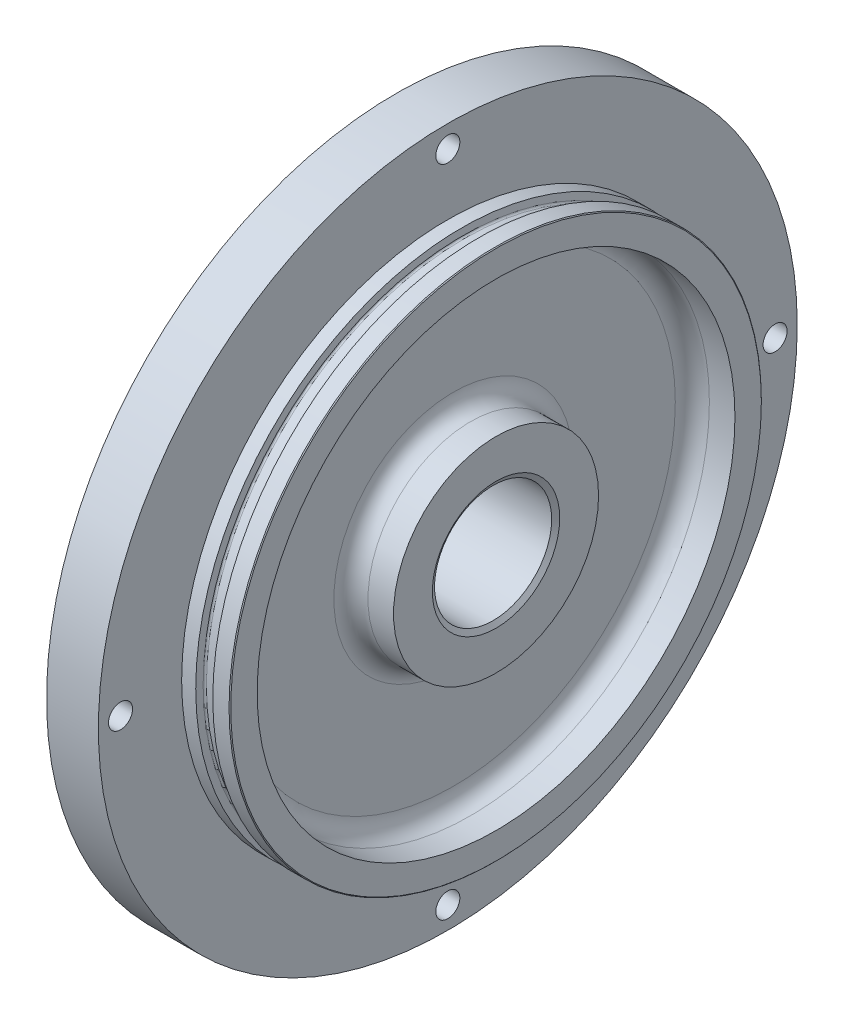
ISO-10303-21;
HEADER;
FILE_DESCRIPTION(('STEP AP214'),'2;1');
FILE_NAME('part.step','',(''),(''),'','','');
FILE_SCHEMA(('AUTOMOTIVE_DESIGN { 1 0 10303 214 1 1 1 1 }'));
ENDSEC;
DATA;
#1=APPLICATION_CONTEXT('core data for automotive mechanical design processes');
#2=APPLICATION_PROTOCOL_DEFINITION('international standard','automotive_design',2000,#1);
#3=PRODUCT_CONTEXT('',#1,'mechanical');
#4=PRODUCT('Part','Part','',(#3));
#5=PRODUCT_RELATED_PRODUCT_CATEGORY('part','',(#4));
#6=PRODUCT_DEFINITION_FORMATION('','',#4);
#7=PRODUCT_DEFINITION_CONTEXT('part definition',#1,'design');
#8=PRODUCT_DEFINITION('design','',#6,#7);
#9=PRODUCT_DEFINITION_SHAPE('','',#8);
#10=(LENGTH_UNIT() NAMED_UNIT(*) SI_UNIT(.MILLI.,.METRE.));
#11=(NAMED_UNIT(*) PLANE_ANGLE_UNIT() SI_UNIT($,.RADIAN.));
#12=(NAMED_UNIT(*) SI_UNIT($,.STERADIAN.) SOLID_ANGLE_UNIT());
#13=UNCERTAINTY_MEASURE_WITH_UNIT(LENGTH_MEASURE(1.E-05),#10,'distance_accuracy_value','');
#14=(GEOMETRIC_REPRESENTATION_CONTEXT(3) GLOBAL_UNCERTAINTY_ASSIGNED_CONTEXT((#13)) GLOBAL_UNIT_ASSIGNED_CONTEXT((#10,
#11,#12)) REPRESENTATION_CONTEXT('',''));
#15=CARTESIAN_POINT('',(0.,0.,0.));
#16=DIRECTION('',(0.,0.,1.));
#17=DIRECTION('',(1.,0.,0.));
#18=AXIS2_PLACEMENT_3D('',#15,#16,#17);
#19=CARTESIAN_POINT('',(0.,0.,0.));
#20=DIRECTION('',(1.,0.,0.));
#21=DIRECTION('',(0.,0.,-1.));
#22=AXIS2_PLACEMENT_3D('',#19,#20,#21);
#23=CYLINDRICAL_SURFACE('',#22,39.6621);
#24=CARTESIAN_POINT('',(-2.80399995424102,0.,0.));
#25=DIRECTION('',(1.,0.,0.));
#26=DIRECTION('',(0.,0.,-1.));
#27=AXIS2_PLACEMENT_3D('',#24,#25,#26);
#28=CIRCLE('',#27,39.6621);
#29=CARTESIAN_POINT('',(-2.80399995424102,0.,-39.6621));
#30=VERTEX_POINT('',#29);
#31=EDGE_CURVE('E51',#30,#30,#28,.F.);
#32=ORIENTED_EDGE('',*,*,#31,.F.);
#33=EDGE_LOOP('',(#32));
#34=FACE_BOUND('',#33,.T.);
#35=CARTESIAN_POINT('',(-0.380999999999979,0.,0.));
#36=DIRECTION('',(1.,0.,0.));
#37=DIRECTION('',(0.,0.,-1.));
#38=AXIS2_PLACEMENT_3D('',#35,#36,#37);
#39=CIRCLE('',#38,39.6621);
#40=CARTESIAN_POINT('',(-0.380999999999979,0.,-39.6621));
#41=VERTEX_POINT('',#40);
#42=EDGE_CURVE('E179',#41,#41,#39,.F.);
#43=ORIENTED_EDGE('',*,*,#42,.T.);
#44=EDGE_LOOP('',(#43));
#45=FACE_BOUND('',#44,.T.);
#46=ADVANCED_FACE('F47',(#34,#45),#23,.T.);
#47=CARTESIAN_POINT('',(0.,0.,0.));
#48=DIRECTION('',(1.,0.,0.));
#49=DIRECTION('',(0.,0.,-1.));
#50=AXIS2_PLACEMENT_3D('',#47,#48,#49);
#51=CYLINDRICAL_SURFACE('',#50,39.6621);
#52=CARTESIAN_POINT('',(-17.26259393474,0.,0.));
#53=DIRECTION('',(1.,0.,0.));
#54=DIRECTION('',(0.,0.,-1.));
#55=AXIS2_PLACEMENT_3D('',#52,#53,#54);
#56=CIRCLE('',#55,39.6621);
#57=CARTESIAN_POINT('',(-17.26259393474,0.,-39.6621));
#58=VERTEX_POINT('',#57);
#59=EDGE_CURVE('E172',#58,#58,#56,.T.);
#60=ORIENTED_EDGE('',*,*,#59,.T.);
#61=EDGE_LOOP('',(#60));
#62=FACE_BOUND('',#61,.T.);
#63=CARTESIAN_POINT('',(-15.1638,0.,0.));
#64=DIRECTION('',(1.,0.,0.));
#65=DIRECTION('',(0.,0.,-1.));
#66=AXIS2_PLACEMENT_3D('',#63,#64,#65);
#67=CIRCLE('',#66,39.6621);
#68=CARTESIAN_POINT('',(-15.1638,0.,-39.6621));
#69=VERTEX_POINT('',#68);
#70=EDGE_CURVE('E138',#69,#69,#67,.T.);
#71=ORIENTED_EDGE('',*,*,#70,.F.);
#72=EDGE_LOOP('',(#71));
#73=FACE_BOUND('',#72,.T.);
#74=ADVANCED_FACE('F249',(#62,#73),#51,.T.);
#75=CARTESIAN_POINT('',(-0.254000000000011,-18.1812732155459,0.));
#76=DIRECTION('',(1.,0.,0.));
#77=DIRECTION('',(0.,0.,-1.));
#78=AXIS2_PLACEMENT_3D('',#75,#76,#77);
#79=PLANE('',#78);
#80=CARTESIAN_POINT('',(-0.254000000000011,0.,0.));
#81=DIRECTION('',(1.,0.,0.));
#82=DIRECTION('',(0.,0.,-1.));
#83=AXIS2_PLACEMENT_3D('',#80,#81,#82);
#84=CIRCLE('',#83,39.5351);
#85=CARTESIAN_POINT('',(-0.254000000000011,0.,-39.5351));
#86=VERTEX_POINT('',#85);
#87=EDGE_CURVE('E168',#86,#86,#84,.T.);
#88=ORIENTED_EDGE('',*,*,#87,.T.);
#89=EDGE_LOOP('',(#88));
#90=FACE_BOUND('',#89,.T.);
#91=CARTESIAN_POINT('',(-0.254000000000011,0.,0.));
#92=DIRECTION('',(1.,0.,0.));
#93=DIRECTION('',(0.,0.,-1.));
#94=AXIS2_PLACEMENT_3D('',#91,#92,#93);
#95=CIRCLE('',#94,35.5999695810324);
#96=CARTESIAN_POINT('',(-0.254000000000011,0.,-35.5999695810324));
#97=VERTEX_POINT('',#96);
#98=EDGE_CURVE('E132',#97,#97,#95,.T.);
#99=ORIENTED_EDGE('',*,*,#98,.F.);
#100=EDGE_LOOP('',(#99));
#101=FACE_BOUND('',#100,.T.);
#102=ADVANCED_FACE('F49',(#90,#101),#79,.T.);
#103=CARTESIAN_POINT('',(-5.34340606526,0.,0.));
#104=DIRECTION('',(-1.,0.,0.));
#105=DIRECTION('',(0.,0.,1.));
#106=AXIS2_PLACEMENT_3D('',#103,#104,#105);
#107=CIRCLE('',#106,39.6621);
#108=CARTESIAN_POINT('',(-5.34340606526,0.,39.6621));
#109=VERTEX_POINT('',#108);
#110=EDGE_CURVE('E195',#109,#109,#107,.F.);
#111=ORIENTED_EDGE('',*,*,#110,.F.);
#112=EDGE_LOOP('',(#111));
#113=FACE_BOUND('',#112,.T.);
#114=CARTESIAN_POINT('',(-7.4422,0.,0.));
#115=DIRECTION('',(1.,0.,0.));
#116=DIRECTION('',(0.,0.,-1.));
#117=AXIS2_PLACEMENT_3D('',#114,#115,#116);
#118=CIRCLE('',#117,39.6621);
#119=CARTESIAN_POINT('',(-7.4422,0.,-39.6621));
#120=VERTEX_POINT('',#119);
#121=EDGE_CURVE('E147',#120,#120,#118,.T.);
#122=ORIENTED_EDGE('',*,*,#121,.T.);
#123=EDGE_LOOP('',(#122));
#124=FACE_BOUND('',#123,.T.);
#125=ADVANCED_FACE('F258',(#113,#124),#23,.T.);
#126=CARTESIAN_POINT('',(-7.44220000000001,-18.1812732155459,0.));
#127=DIRECTION('',(-1.,0.,0.));
#128=DIRECTION('',(0.,0.,1.));
#129=AXIS2_PLACEMENT_3D('',#126,#127,#128);
#130=PLANE('',#129);
#131=CARTESIAN_POINT('',(-7.44220000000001,5.10817981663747E-13,-48.768));
#132=DIRECTION('',(-1.,0.,0.));
#133=DIRECTION('',(0.,0.,1.));
#134=AXIS2_PLACEMENT_3D('',#131,#132,#133);
#135=CIRCLE('',#134,1.7907);
#136=CARTESIAN_POINT('',(-7.44220000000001,5.10817981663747E-13,-46.9773));
#137=VERTEX_POINT('',#136);
#138=EDGE_CURVE('E111',#137,#137,#135,.T.);
#139=ORIENTED_EDGE('',*,*,#138,.T.);
#140=EDGE_LOOP('',(#139));
#141=FACE_BOUND('',#140,.T.);
#142=CARTESIAN_POINT('',(-7.44220000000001,-48.768,-3.40545321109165E-13));
#143=DIRECTION('',(-1.,0.,0.));
#144=DIRECTION('',(0.,0.,1.));
#145=AXIS2_PLACEMENT_3D('',#142,#143,#144);
#146=CIRCLE('',#145,1.7907);
#147=CARTESIAN_POINT('',(-7.44220000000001,-48.768,1.79069999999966));
#148=VERTEX_POINT('',#147);
#149=EDGE_CURVE('E117',#148,#148,#146,.T.);
#150=ORIENTED_EDGE('',*,*,#149,.T.);
#151=EDGE_LOOP('',(#150));
#152=FACE_BOUND('',#151,.T.);
#153=CARTESIAN_POINT('',(-7.44220000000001,-1.70272660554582E-13,48.768));
#154=DIRECTION('',(-1.,0.,0.));
#155=DIRECTION('',(0.,0.,1.));
#156=AXIS2_PLACEMENT_3D('',#153,#154,#155);
#157=CIRCLE('',#156,1.7907);
#158=CARTESIAN_POINT('',(-7.44220000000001,-1.70272660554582E-13,50.5587));
#159=VERTEX_POINT('',#158);
#160=EDGE_CURVE('E123',#159,#159,#157,.T.);
#161=ORIENTED_EDGE('',*,*,#160,.T.);
#162=EDGE_LOOP('',(#161));
#163=FACE_BOUND('',#162,.T.);
#164=CARTESIAN_POINT('',(-7.44220000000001,48.768,0.));
#165=DIRECTION('',(-1.,0.,0.));
#166=DIRECTION('',(0.,0.,1.));
#167=AXIS2_PLACEMENT_3D('',#164,#165,#166);
#168=CIRCLE('',#167,1.7907);
#169=CARTESIAN_POINT('',(-7.44220000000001,48.768,1.7907));
#170=VERTEX_POINT('',#169);
#171=EDGE_CURVE('E129',#170,#170,#168,.T.);
#172=ORIENTED_EDGE('',*,*,#171,.T.);
#173=EDGE_LOOP('',(#172));
#174=FACE_BOUND('',#173,.T.);
#175=ORIENTED_EDGE('',*,*,#121,.F.);
#176=EDGE_LOOP('',(#175));
#177=FACE_BOUND('',#176,.T.);
#178=CARTESIAN_POINT('',(-7.44220000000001,0.,0.));
#179=DIRECTION('',(1.,0.,0.));
#180=DIRECTION('',(0.,0.,-1.));
#181=AXIS2_PLACEMENT_3D('',#178,#179,#180);
#182=CIRCLE('',#181,52.07);
#183=CARTESIAN_POINT('',(-7.44220000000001,0.,-52.07));
#184=VERTEX_POINT('',#183);
#185=EDGE_CURVE('E144',#184,#184,#182,.T.);
#186=ORIENTED_EDGE('',*,*,#185,.T.);
#187=EDGE_LOOP('',(#186));
#188=FACE_BOUND('',#187,.T.);
#189=ADVANCED_FACE('F621',(#141,#152,#163,#174,#177,#188),#130,.F.);
#190=CARTESIAN_POINT('',(0.,0.,0.));
#191=DIRECTION('',(1.,0.,0.));
#192=DIRECTION('',(0.,0.,-1.));
#193=AXIS2_PLACEMENT_3D('',#190,#191,#192);
#194=CYLINDRICAL_SURFACE('',#193,52.07);
#195=ORIENTED_EDGE('',*,*,#185,.F.);
#196=EDGE_LOOP('',(#195));
#197=FACE_BOUND('',#196,.T.);
#198=CARTESIAN_POINT('',(-15.1638,0.,0.));
#199=DIRECTION('',(1.,0.,0.));
#200=DIRECTION('',(0.,0.,-1.));
#201=AXIS2_PLACEMENT_3D('',#198,#199,#200);
#202=CIRCLE('',#201,52.07);
#203=CARTESIAN_POINT('',(-15.1638,0.,-52.07));
#204=VERTEX_POINT('',#203);
#205=EDGE_CURVE('E141',#204,#204,#202,.T.);
#206=ORIENTED_EDGE('',*,*,#205,.T.);
#207=EDGE_LOOP('',(#206));
#208=FACE_BOUND('',#207,.T.);
#209=ADVANCED_FACE('F502',(#197,#208),#194,.T.);
#210=CARTESIAN_POINT('',(-15.1638,-18.1812732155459,0.));
#211=DIRECTION('',(1.,0.,0.));
#212=DIRECTION('',(0.,0.,-1.));
#213=AXIS2_PLACEMENT_3D('',#210,#211,#212);
#214=PLANE('',#213);
#215=CARTESIAN_POINT('',(-15.1638,0.,0.));
#216=DIRECTION('',(1.,0.,0.));
#217=DIRECTION('',(0.,0.,-1.));
#218=AXIS2_PLACEMENT_3D('',#215,#216,#217);
#219=CIRCLE('',#218,43.8721696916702);
#220=CARTESIAN_POINT('',(-15.1638,0.,-43.8721696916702));
#221=VERTEX_POINT('',#220);
#222=EDGE_CURVE('E233',#221,#221,#219,.T.);
#223=ORIENTED_EDGE('',*,*,#222,.T.);
#224=EDGE_LOOP('',(#223));
#225=FACE_BOUND('',#224,.T.);
#226=CARTESIAN_POINT('',(-15.1638,5.10817981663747E-13,-48.768));
#227=DIRECTION('',(-1.,0.,0.));
#228=DIRECTION('',(0.,1.,0.));
#229=AXIS2_PLACEMENT_3D('',#226,#227,#228);
#230=CIRCLE('',#229,1.7907);
#231=CARTESIAN_POINT('',(-15.1638,5.10817981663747E-13,-46.9773));
#232=VERTEX_POINT('',#231);
#233=EDGE_CURVE('E108',#232,#232,#230,.T.);
#234=ORIENTED_EDGE('',*,*,#233,.F.);
#235=EDGE_LOOP('',(#234));
#236=FACE_BOUND('',#235,.T.);
#237=CARTESIAN_POINT('',(-15.1638,-48.768,-3.40545321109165E-13));
#238=DIRECTION('',(-1.,0.,0.));
#239=DIRECTION('',(0.,0.,-1.));
#240=AXIS2_PLACEMENT_3D('',#237,#238,#239);
#241=CIRCLE('',#240,1.7907);
#242=CARTESIAN_POINT('',(-15.1638,-48.768,1.79069999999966));
#243=VERTEX_POINT('',#242);
#244=EDGE_CURVE('E114',#243,#243,#241,.T.);
#245=ORIENTED_EDGE('',*,*,#244,.F.);
#246=EDGE_LOOP('',(#245));
#247=FACE_BOUND('',#246,.T.);
#248=CARTESIAN_POINT('',(-15.1638,-1.70272660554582E-13,48.768));
#249=DIRECTION('',(-1.,0.,0.));
#250=DIRECTION('',(0.,-1.,0.));
#251=AXIS2_PLACEMENT_3D('',#248,#249,#250);
#252=CIRCLE('',#251,1.7907);
#253=CARTESIAN_POINT('',(-15.1638,-1.70272660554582E-13,50.5587));
#254=VERTEX_POINT('',#253);
#255=EDGE_CURVE('E120',#254,#254,#252,.T.);
#256=ORIENTED_EDGE('',*,*,#255,.F.);
#257=EDGE_LOOP('',(#256));
#258=FACE_BOUND('',#257,.T.);
#259=CARTESIAN_POINT('',(-15.1638,48.768,0.));
#260=DIRECTION('',(-1.,0.,0.));
#261=DIRECTION('',(0.,0.,1.));
#262=AXIS2_PLACEMENT_3D('',#259,#260,#261);
#263=CIRCLE('',#262,1.7907);
#264=CARTESIAN_POINT('',(-15.1638,48.768,1.7907));
#265=VERTEX_POINT('',#264);
#266=EDGE_CURVE('E126',#265,#265,#263,.T.);
#267=ORIENTED_EDGE('',*,*,#266,.F.);
#268=EDGE_LOOP('',(#267));
#269=FACE_BOUND('',#268,.T.);
#270=ORIENTED_EDGE('',*,*,#205,.F.);
#271=EDGE_LOOP('',(#270));
#272=FACE_BOUND('',#271,.T.);
#273=ADVANCED_FACE('F246',(#225,#236,#247,#258,#269,#272),#214,.F.);
#274=CARTESIAN_POINT('',(-0.254000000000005,-18.1812732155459,0.));
#275=DIRECTION('',(-1.,0.,0.));
#276=DIRECTION('',(0.,0.,1.));
#277=AXIS2_PLACEMENT_3D('',#274,#275,#276);
#278=PLANE('',#277);
#279=CARTESIAN_POINT('',(-0.254000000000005,0.,0.));
#280=DIRECTION('',(-1.,0.,0.));
#281=DIRECTION('',(0.,0.,1.));
#282=AXIS2_PLACEMENT_3D('',#279,#280,#281);
#283=CIRCLE('',#282,9.48690000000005);
#284=CARTESIAN_POINT('',(-0.254000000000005,0.,9.48690000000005));
#285=VERTEX_POINT('',#284);
#286=EDGE_CURVE('E191',#285,#285,#283,.T.);
#287=ORIENTED_EDGE('',*,*,#286,.T.);
#288=EDGE_LOOP('',(#287));
#289=FACE_BOUND('',#288,.T.);
#290=CARTESIAN_POINT('',(-0.254000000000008,0.,0.));
#291=DIRECTION('',(1.,0.,0.));
#292=DIRECTION('',(0.,0.,-1.));
#293=AXIS2_PLACEMENT_3D('',#290,#291,#292);
#294=CIRCLE('',#293,15.2770837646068);
#295=CARTESIAN_POINT('',(-0.254000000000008,0.,-15.2770837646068));
#296=VERTEX_POINT('',#295);
#297=EDGE_CURVE('E135',#296,#296,#294,.T.);
#298=ORIENTED_EDGE('',*,*,#297,.T.);
#299=EDGE_LOOP('',(#298));
#300=FACE_BOUND('',#299,.T.);
#301=ADVANCED_FACE('F375',(#289,#300),#278,.F.);
#302=CARTESIAN_POINT('',(0.,0.,0.));
#303=DIRECTION('',(1.,0.,0.));
#304=DIRECTION('',(0.,0.,-1.));
#305=AXIS2_PLACEMENT_3D('',#302,#303,#304);
#306=CYLINDRICAL_SURFACE('',#305,15.2770837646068);
#307=CARTESIAN_POINT('',(-4.06400000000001,0.,0.));
#308=DIRECTION('',(1.,0.,0.));
#309=DIRECTION('',(0.,0.,-1.));
#310=AXIS2_PLACEMENT_3D('',#307,#308,#309);
#311=CIRCLE('',#310,15.2770837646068);
#312=CARTESIAN_POINT('',(-4.06400000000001,0.,-15.2770837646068));
#313=VERTEX_POINT('',#312);
#314=EDGE_CURVE('E150',#313,#313,#311,.T.);
#315=ORIENTED_EDGE('',*,*,#314,.T.);
#316=EDGE_LOOP('',(#315));
#317=FACE_BOUND('',#316,.T.);
#318=ORIENTED_EDGE('',*,*,#297,.F.);
#319=EDGE_LOOP('',(#318));
#320=FACE_BOUND('',#319,.T.);
#321=ADVANCED_FACE('F371',(#317,#320),#306,.T.);
#322=CARTESIAN_POINT('',(-6.60400000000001,-18.1812732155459,0.));
#323=DIRECTION('',(1.,0.,0.));
#324=DIRECTION('',(0.,0.,-1.));
#325=AXIS2_PLACEMENT_3D('',#322,#323,#324);
#326=PLANE('',#325);
#327=CARTESIAN_POINT('',(-6.60400000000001,0.,0.));
#328=DIRECTION('',(1.,0.,0.));
#329=DIRECTION('',(0.,0.,-1.));
#330=AXIS2_PLACEMENT_3D('',#327,#328,#329);
#331=CIRCLE('',#330,17.8170837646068);
#332=CARTESIAN_POINT('',(-6.60400000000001,0.,-17.8170837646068));
#333=VERTEX_POINT('',#332);
#334=EDGE_CURVE('E156',#333,#333,#331,.F.);
#335=ORIENTED_EDGE('',*,*,#334,.T.);
#336=EDGE_LOOP('',(#335));
#337=FACE_BOUND('',#336,.T.);
#338=CARTESIAN_POINT('',(-6.60400000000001,0.,0.));
#339=DIRECTION('',(1.,0.,0.));
#340=DIRECTION('',(0.,0.,-1.));
#341=AXIS2_PLACEMENT_3D('',#338,#339,#340);
#342=CIRCLE('',#341,33.0599695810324);
#343=CARTESIAN_POINT('',(-6.60400000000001,0.,-33.0599695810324));
#344=VERTEX_POINT('',#343);
#345=EDGE_CURVE('E153',#344,#344,#342,.T.);
#346=ORIENTED_EDGE('',*,*,#345,.T.);
#347=EDGE_LOOP('',(#346));
#348=FACE_BOUND('',#347,.T.);
#349=ADVANCED_FACE('F367',(#337,#348),#326,.T.);
#350=CARTESIAN_POINT('',(0.,0.,0.));
#351=DIRECTION('',(1.,0.,0.));
#352=DIRECTION('',(0.,0.,-1.));
#353=AXIS2_PLACEMENT_3D('',#350,#351,#352);
#354=CYLINDRICAL_SURFACE('',#353,35.5999695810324);
#355=CARTESIAN_POINT('',(-4.06400000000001,0.,0.));
#356=DIRECTION('',(1.,0.,0.));
#357=DIRECTION('',(0.,0.,-1.));
#358=AXIS2_PLACEMENT_3D('',#355,#356,#357);
#359=CIRCLE('',#358,35.5999695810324);
#360=CARTESIAN_POINT('',(-4.06400000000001,0.,-35.5999695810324));
#361=VERTEX_POINT('',#360);
#362=EDGE_CURVE('E159',#361,#361,#359,.F.);
#363=ORIENTED_EDGE('',*,*,#362,.T.);
#364=EDGE_LOOP('',(#363));
#365=FACE_BOUND('',#364,.T.);
#366=ORIENTED_EDGE('',*,*,#98,.T.);
#367=EDGE_LOOP('',(#366));
#368=FACE_BOUND('',#367,.T.);
#369=ADVANCED_FACE('F363',(#365,#368),#354,.F.);
#370=CARTESIAN_POINT('',(-0.254000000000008,48.768,0.));
#371=DIRECTION('',(-1.,0.,0.));
#372=DIRECTION('',(0.,0.,1.));
#373=AXIS2_PLACEMENT_3D('',#370,#371,#372);
#374=CYLINDRICAL_SURFACE('',#373,1.7907);
#375=CARTESIAN_POINT('',(-15.1638,48.768,1.7907));
#376=CARTESIAN_POINT('',(-15.0833666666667,48.768,1.7907));
#377=CARTESIAN_POINT('',(-15.0029333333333,48.768,1.7907));
#378=CARTESIAN_POINT('',(-14.8420666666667,48.768,1.7907));
#379=CARTESIAN_POINT('',(-14.7616333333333,48.768,1.7907));
#380=CARTESIAN_POINT('',(-14.6007666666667,48.768,1.7907));
#381=CARTESIAN_POINT('',(-14.5203333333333,48.768,1.7907));
#382=CARTESIAN_POINT('',(-14.3594666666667,48.768,1.7907));
#383=CARTESIAN_POINT('',(-14.2790333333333,48.768,1.7907));
#384=CARTESIAN_POINT('',(-14.1181666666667,48.768,1.7907));
#385=CARTESIAN_POINT('',(-14.0377333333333,48.768,1.7907));
#386=CARTESIAN_POINT('',(-13.8768666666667,48.768,1.7907));
#387=CARTESIAN_POINT('',(-13.7964333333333,48.768,1.7907));
#388=CARTESIAN_POINT('',(-13.6355666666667,48.768,1.7907));
#389=CARTESIAN_POINT('',(-13.5551333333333,48.768,1.7907));
#390=CARTESIAN_POINT('',(-13.3942666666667,48.768,1.7907));
#391=CARTESIAN_POINT('',(-13.3138333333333,48.768,1.7907));
#392=CARTESIAN_POINT('',(-13.1529666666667,48.768,1.7907));
#393=CARTESIAN_POINT('',(-13.0725333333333,48.768,1.7907));
#394=CARTESIAN_POINT('',(-12.9116666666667,48.768,1.7907));
#395=CARTESIAN_POINT('',(-12.8312333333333,48.768,1.7907));
#396=CARTESIAN_POINT('',(-12.6703666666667,48.768,1.7907));
#397=CARTESIAN_POINT('',(-12.5899333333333,48.768,1.7907));
#398=CARTESIAN_POINT('',(-12.4290666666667,48.768,1.7907));
#399=CARTESIAN_POINT('',(-12.3486333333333,48.768,1.7907));
#400=CARTESIAN_POINT('',(-12.1877666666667,48.768,1.7907));
#401=CARTESIAN_POINT('',(-12.1073333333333,48.768,1.7907));
#402=CARTESIAN_POINT('',(-11.9464666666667,48.768,1.7907));
#403=CARTESIAN_POINT('',(-11.8660333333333,48.768,1.7907));
#404=CARTESIAN_POINT('',(-11.7051666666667,48.768,1.7907));
#405=CARTESIAN_POINT('',(-11.6247333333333,48.768,1.7907));
#406=CARTESIAN_POINT('',(-11.4638666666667,48.768,1.7907));
#407=CARTESIAN_POINT('',(-11.3834333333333,48.768,1.7907));
#408=CARTESIAN_POINT('',(-11.2225666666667,48.768,1.7907));
#409=CARTESIAN_POINT('',(-11.1421333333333,48.768,1.7907));
#410=CARTESIAN_POINT('',(-10.9812666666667,48.768,1.7907));
#411=CARTESIAN_POINT('',(-10.9008333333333,48.768,1.7907));
#412=CARTESIAN_POINT('',(-10.7399666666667,48.768,1.7907));
#413=CARTESIAN_POINT('',(-10.6595333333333,48.768,1.7907));
#414=CARTESIAN_POINT('',(-10.4986666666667,48.768,1.7907));
#415=CARTESIAN_POINT('',(-10.4182333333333,48.768,1.7907));
#416=CARTESIAN_POINT('',(-10.2573666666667,48.768,1.7907));
#417=CARTESIAN_POINT('',(-10.1769333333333,48.768,1.7907));
#418=CARTESIAN_POINT('',(-10.0160666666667,48.768,1.7907));
#419=CARTESIAN_POINT('',(-9.93563333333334,48.768,1.7907));
#420=CARTESIAN_POINT('',(-9.77476666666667,48.768,1.7907));
#421=CARTESIAN_POINT('',(-9.69433333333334,48.768,1.7907));
#422=CARTESIAN_POINT('',(-9.53346666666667,48.768,1.7907));
#423=CARTESIAN_POINT('',(-9.45303333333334,48.768,1.7907));
#424=CARTESIAN_POINT('',(-9.29216666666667,48.768,1.7907));
#425=CARTESIAN_POINT('',(-9.21173333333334,48.768,1.7907));
#426=CARTESIAN_POINT('',(-9.05086666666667,48.768,1.7907));
#427=CARTESIAN_POINT('',(-8.97043333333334,48.768,1.7907));
#428=CARTESIAN_POINT('',(-8.80956666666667,48.768,1.7907));
#429=CARTESIAN_POINT('',(-8.72913333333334,48.768,1.7907));
#430=CARTESIAN_POINT('',(-8.56826666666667,48.768,1.7907));
#431=CARTESIAN_POINT('',(-8.48783333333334,48.768,1.7907));
#432=CARTESIAN_POINT('',(-8.32696666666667,48.768,1.7907));
#433=CARTESIAN_POINT('',(-8.24653333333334,48.768,1.7907));
#434=CARTESIAN_POINT('',(-8.08566666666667,48.768,1.7907));
#435=CARTESIAN_POINT('',(-8.00523333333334,48.768,1.7907));
#436=CARTESIAN_POINT('',(-7.84436666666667,48.768,1.7907));
#437=CARTESIAN_POINT('',(-7.76393333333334,48.768,1.7907));
#438=CARTESIAN_POINT('',(-7.60306666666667,48.768,1.7907));
#439=CARTESIAN_POINT('',(-7.52263333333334,48.768,1.7907));
#440=CARTESIAN_POINT('',(-7.44220000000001,48.768,1.7907));
#441=B_SPLINE_CURVE_WITH_KNOTS('',3,(#375,#376,#377,#378,#379,#380,#381,#382,#383,#384,#385,
#386,#387,#388,#389,#390,#391,#392,#393,#394,#395,#396,#397,#398,#399,#400,#401,#402,#403,#404,
#405,#406,#407,#408,#409,#410,#411,#412,#413,#414,#415,#416,#417,#418,#419,#420,#421,#422,#423,
#424,#425,#426,#427,#428,#429,#430,#431,#432,#433,#434,#435,#436,#437,#438,#439,#440),
.UNSPECIFIED.,.F.,.F.,(4,2,2,2,2,2,2,2,2,2,2,2,2,2,2,2,2,2,2,2,2,2,2,2,2,2,2,2,2,2,2,2,4),(0.,
0.2413,0.4826,0.7239,0.965199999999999,1.2065,1.4478,1.6891,1.9304,2.1717,2.413,2.6543,2.8956,
3.1369,3.3782,3.6195,3.8608,4.1021,4.3434,4.5847,4.826,5.0673,5.3086,5.5499,5.7912,6.0325,
6.2738,6.5151,6.7564,6.9977,7.23899999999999,7.48029999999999,7.72159999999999),.UNSPECIFIED.);
#442=EDGE_CURVE('BSEAM359',#265,#170,#441,.T.);
#443=ORIENTED_EDGE('',*,*,#266,.T.);
#444=ORIENTED_EDGE('',*,*,#171,.F.);
#445=ORIENTED_EDGE('',*,*,#442,.T.);
#446=ORIENTED_EDGE('',*,*,#442,.F.);
#447=EDGE_LOOP('',(#443,#445,#444,#446));
#448=FACE_BOUND('',#447,.T.);
#449=ADVANCED_FACE('F359',(#448),#374,.F.);
#450=CARTESIAN_POINT('',(-0.254000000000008,-1.70272660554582E-13,48.768));
#451=DIRECTION('',(-1.,0.,0.));
#452=DIRECTION('',(0.,0.,1.));
#453=AXIS2_PLACEMENT_3D('',#450,#451,#452);
#454=CYLINDRICAL_SURFACE('',#453,1.7907);
#455=CARTESIAN_POINT('',(-15.1638,-1.70272660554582E-13,50.5587));
#456=CARTESIAN_POINT('',(-15.0833666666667,-1.70272660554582E-13,50.5587));
#457=CARTESIAN_POINT('',(-15.0029333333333,-1.70272660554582E-13,50.5587));
#458=CARTESIAN_POINT('',(-14.8420666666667,-1.70272660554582E-13,50.5587));
#459=CARTESIAN_POINT('',(-14.7616333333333,-1.70272660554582E-13,50.5587));
#460=CARTESIAN_POINT('',(-14.6007666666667,-1.70272660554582E-13,50.5587));
#461=CARTESIAN_POINT('',(-14.5203333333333,-1.70272660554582E-13,50.5587));
#462=CARTESIAN_POINT('',(-14.3594666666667,-1.70272660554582E-13,50.5587));
#463=CARTESIAN_POINT('',(-14.2790333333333,-1.70272660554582E-13,50.5587));
#464=CARTESIAN_POINT('',(-14.1181666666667,-1.70272660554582E-13,50.5587));
#465=CARTESIAN_POINT('',(-14.0377333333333,-1.70272660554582E-13,50.5587));
#466=CARTESIAN_POINT('',(-13.8768666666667,-1.70272660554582E-13,50.5587));
#467=CARTESIAN_POINT('',(-13.7964333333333,-1.70272660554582E-13,50.5587));
#468=CARTESIAN_POINT('',(-13.6355666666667,-1.70272660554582E-13,50.5587));
#469=CARTESIAN_POINT('',(-13.5551333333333,-1.70272660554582E-13,50.5587));
#470=CARTESIAN_POINT('',(-13.3942666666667,-1.70272660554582E-13,50.5587));
#471=CARTESIAN_POINT('',(-13.3138333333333,-1.70272660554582E-13,50.5587));
#472=CARTESIAN_POINT('',(-13.1529666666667,-1.70272660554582E-13,50.5587));
#473=CARTESIAN_POINT('',(-13.0725333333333,-1.70272660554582E-13,50.5587));
#474=CARTESIAN_POINT('',(-12.9116666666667,-1.70272660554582E-13,50.5587));
#475=CARTESIAN_POINT('',(-12.8312333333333,-1.70272660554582E-13,50.5587));
#476=CARTESIAN_POINT('',(-12.6703666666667,-1.70272660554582E-13,50.5587));
#477=CARTESIAN_POINT('',(-12.5899333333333,-1.70272660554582E-13,50.5587));
#478=CARTESIAN_POINT('',(-12.4290666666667,-1.70272660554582E-13,50.5587));
#479=CARTESIAN_POINT('',(-12.3486333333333,-1.70272660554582E-13,50.5587));
#480=CARTESIAN_POINT('',(-12.1877666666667,-1.70272660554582E-13,50.5587));
#481=CARTESIAN_POINT('',(-12.1073333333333,-1.70272660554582E-13,50.5587));
#482=CARTESIAN_POINT('',(-11.9464666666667,-1.70272660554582E-13,50.5587));
#483=CARTESIAN_POINT('',(-11.8660333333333,-1.70272660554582E-13,50.5587));
#484=CARTESIAN_POINT('',(-11.7051666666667,-1.70272660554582E-13,50.5587));
#485=CARTESIAN_POINT('',(-11.6247333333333,-1.70272660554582E-13,50.5587));
#486=CARTESIAN_POINT('',(-11.4638666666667,-1.70272660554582E-13,50.5587));
#487=CARTESIAN_POINT('',(-11.3834333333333,-1.70272660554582E-13,50.5587));
#488=CARTESIAN_POINT('',(-11.2225666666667,-1.70272660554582E-13,50.5587));
#489=CARTESIAN_POINT('',(-11.1421333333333,-1.70272660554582E-13,50.5587));
#490=CARTESIAN_POINT('',(-10.9812666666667,-1.70272660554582E-13,50.5587));
#491=CARTESIAN_POINT('',(-10.9008333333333,-1.70272660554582E-13,50.5587));
#492=CARTESIAN_POINT('',(-10.7399666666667,-1.70272660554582E-13,50.5587));
#493=CARTESIAN_POINT('',(-10.6595333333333,-1.70272660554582E-13,50.5587));
#494=CARTESIAN_POINT('',(-10.4986666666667,-1.70272660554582E-13,50.5587));
#495=CARTESIAN_POINT('',(-10.4182333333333,-1.70272660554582E-13,50.5587));
#496=CARTESIAN_POINT('',(-10.2573666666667,-1.70272660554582E-13,50.5587));
#497=CARTESIAN_POINT('',(-10.1769333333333,-1.70272660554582E-13,50.5587));
#498=CARTESIAN_POINT('',(-10.0160666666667,-1.70272660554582E-13,50.5587));
#499=CARTESIAN_POINT('',(-9.93563333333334,-1.70272660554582E-13,50.5587));
#500=CARTESIAN_POINT('',(-9.77476666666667,-1.70272660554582E-13,50.5587));
#501=CARTESIAN_POINT('',(-9.69433333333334,-1.70272660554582E-13,50.5587));
#502=CARTESIAN_POINT('',(-9.53346666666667,-1.70272660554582E-13,50.5587));
#503=CARTESIAN_POINT('',(-9.45303333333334,-1.70272660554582E-13,50.5587));
#504=CARTESIAN_POINT('',(-9.29216666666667,-1.70272660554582E-13,50.5587));
#505=CARTESIAN_POINT('',(-9.21173333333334,-1.70272660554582E-13,50.5587));
#506=CARTESIAN_POINT('',(-9.05086666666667,-1.70272660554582E-13,50.5587));
#507=CARTESIAN_POINT('',(-8.97043333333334,-1.70272660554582E-13,50.5587));
#508=CARTESIAN_POINT('',(-8.80956666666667,-1.70272660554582E-13,50.5587));
#509=CARTESIAN_POINT('',(-8.72913333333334,-1.70272660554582E-13,50.5587));
#510=CARTESIAN_POINT('',(-8.56826666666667,-1.70272660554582E-13,50.5587));
#511=CARTESIAN_POINT('',(-8.48783333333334,-1.70272660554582E-13,50.5587));
#512=CARTESIAN_POINT('',(-8.32696666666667,-1.70272660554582E-13,50.5587));
#513=CARTESIAN_POINT('',(-8.24653333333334,-1.70272660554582E-13,50.5587));
#514=CARTESIAN_POINT('',(-8.08566666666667,-1.70272660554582E-13,50.5587));
#515=CARTESIAN_POINT('',(-8.00523333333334,-1.70272660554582E-13,50.5587));
#516=CARTESIAN_POINT('',(-7.84436666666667,-1.70272660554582E-13,50.5587));
#517=CARTESIAN_POINT('',(-7.76393333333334,-1.70272660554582E-13,50.5587));
#518=CARTESIAN_POINT('',(-7.60306666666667,-1.70272660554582E-13,50.5587));
#519=CARTESIAN_POINT('',(-7.52263333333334,-1.70272660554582E-13,50.5587));
#520=CARTESIAN_POINT('',(-7.44220000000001,-1.70272660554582E-13,50.5587));
#521=B_SPLINE_CURVE_WITH_KNOTS('',3,(#455,#456,#457,#458,#459,#460,#461,#462,#463,#464,#465,
#466,#467,#468,#469,#470,#471,#472,#473,#474,#475,#476,#477,#478,#479,#480,#481,#482,#483,#484,
#485,#486,#487,#488,#489,#490,#491,#492,#493,#494,#495,#496,#497,#498,#499,#500,#501,#502,#503,
#504,#505,#506,#507,#508,#509,#510,#511,#512,#513,#514,#515,#516,#517,#518,#519,#520),
.UNSPECIFIED.,.F.,.F.,(4,2,2,2,2,2,2,2,2,2,2,2,2,2,2,2,2,2,2,2,2,2,2,2,2,2,2,2,2,2,2,2,4),(0.,
0.2413,0.4826,0.7239,0.965199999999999,1.2065,1.4478,1.6891,1.9304,2.1717,2.413,2.6543,2.8956,
3.1369,3.3782,3.6195,3.8608,4.1021,4.3434,4.5847,4.826,5.0673,5.3086,5.5499,5.7912,6.0325,
6.2738,6.5151,6.7564,6.9977,7.23899999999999,7.48029999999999,7.72159999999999),.UNSPECIFIED.);
#522=EDGE_CURVE('BSEAM355',#254,#159,#521,.T.);
#523=ORIENTED_EDGE('',*,*,#255,.T.);
#524=ORIENTED_EDGE('',*,*,#160,.F.);
#525=ORIENTED_EDGE('',*,*,#522,.T.);
#526=ORIENTED_EDGE('',*,*,#522,.F.);
#527=EDGE_LOOP('',(#523,#525,#524,#526));
#528=FACE_BOUND('',#527,.T.);
#529=ADVANCED_FACE('F355',(#528),#454,.F.);
#530=CARTESIAN_POINT('',(-0.254000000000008,-48.768,-3.40545321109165E-13));
#531=DIRECTION('',(-1.,0.,0.));
#532=DIRECTION('',(0.,0.,1.));
#533=AXIS2_PLACEMENT_3D('',#530,#531,#532);
#534=CYLINDRICAL_SURFACE('',#533,1.7907);
#535=CARTESIAN_POINT('',(-15.1638,-48.768,1.79069999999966));
#536=CARTESIAN_POINT('',(-15.0833666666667,-48.768,1.79069999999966));
#537=CARTESIAN_POINT('',(-15.0029333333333,-48.768,1.79069999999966));
#538=CARTESIAN_POINT('',(-14.8420666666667,-48.768,1.79069999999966));
#539=CARTESIAN_POINT('',(-14.7616333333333,-48.768,1.79069999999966));
#540=CARTESIAN_POINT('',(-14.6007666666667,-48.768,1.79069999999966));
#541=CARTESIAN_POINT('',(-14.5203333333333,-48.768,1.79069999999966));
#542=CARTESIAN_POINT('',(-14.3594666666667,-48.768,1.79069999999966));
#543=CARTESIAN_POINT('',(-14.2790333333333,-48.768,1.79069999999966));
#544=CARTESIAN_POINT('',(-14.1181666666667,-48.768,1.79069999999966));
#545=CARTESIAN_POINT('',(-14.0377333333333,-48.768,1.79069999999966));
#546=CARTESIAN_POINT('',(-13.8768666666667,-48.768,1.79069999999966));
#547=CARTESIAN_POINT('',(-13.7964333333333,-48.768,1.79069999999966));
#548=CARTESIAN_POINT('',(-13.6355666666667,-48.768,1.79069999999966));
#549=CARTESIAN_POINT('',(-13.5551333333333,-48.768,1.79069999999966));
#550=CARTESIAN_POINT('',(-13.3942666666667,-48.768,1.79069999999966));
#551=CARTESIAN_POINT('',(-13.3138333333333,-48.768,1.79069999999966));
#552=CARTESIAN_POINT('',(-13.1529666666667,-48.768,1.79069999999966));
#553=CARTESIAN_POINT('',(-13.0725333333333,-48.768,1.79069999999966));
#554=CARTESIAN_POINT('',(-12.9116666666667,-48.768,1.79069999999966));
#555=CARTESIAN_POINT('',(-12.8312333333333,-48.768,1.79069999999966));
#556=CARTESIAN_POINT('',(-12.6703666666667,-48.768,1.79069999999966));
#557=CARTESIAN_POINT('',(-12.5899333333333,-48.768,1.79069999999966));
#558=CARTESIAN_POINT('',(-12.4290666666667,-48.768,1.79069999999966));
#559=CARTESIAN_POINT('',(-12.3486333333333,-48.768,1.79069999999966));
#560=CARTESIAN_POINT('',(-12.1877666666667,-48.768,1.79069999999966));
#561=CARTESIAN_POINT('',(-12.1073333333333,-48.768,1.79069999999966));
#562=CARTESIAN_POINT('',(-11.9464666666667,-48.768,1.79069999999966));
#563=CARTESIAN_POINT('',(-11.8660333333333,-48.768,1.79069999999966));
#564=CARTESIAN_POINT('',(-11.7051666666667,-48.768,1.79069999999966));
#565=CARTESIAN_POINT('',(-11.6247333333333,-48.768,1.79069999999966));
#566=CARTESIAN_POINT('',(-11.4638666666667,-48.768,1.79069999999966));
#567=CARTESIAN_POINT('',(-11.3834333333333,-48.768,1.79069999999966));
#568=CARTESIAN_POINT('',(-11.2225666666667,-48.768,1.79069999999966));
#569=CARTESIAN_POINT('',(-11.1421333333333,-48.768,1.79069999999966));
#570=CARTESIAN_POINT('',(-10.9812666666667,-48.768,1.79069999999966));
#571=CARTESIAN_POINT('',(-10.9008333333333,-48.768,1.79069999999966));
#572=CARTESIAN_POINT('',(-10.7399666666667,-48.768,1.79069999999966));
#573=CARTESIAN_POINT('',(-10.6595333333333,-48.768,1.79069999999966));
#574=CARTESIAN_POINT('',(-10.4986666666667,-48.768,1.79069999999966));
#575=CARTESIAN_POINT('',(-10.4182333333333,-48.768,1.79069999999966));
#576=CARTESIAN_POINT('',(-10.2573666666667,-48.768,1.79069999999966));
#577=CARTESIAN_POINT('',(-10.1769333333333,-48.768,1.79069999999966));
#578=CARTESIAN_POINT('',(-10.0160666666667,-48.768,1.79069999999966));
#579=CARTESIAN_POINT('',(-9.93563333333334,-48.768,1.79069999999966));
#580=CARTESIAN_POINT('',(-9.77476666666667,-48.768,1.79069999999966));
#581=CARTESIAN_POINT('',(-9.69433333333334,-48.768,1.79069999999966));
#582=CARTESIAN_POINT('',(-9.53346666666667,-48.768,1.79069999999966));
#583=CARTESIAN_POINT('',(-9.45303333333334,-48.768,1.79069999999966));
#584=CARTESIAN_POINT('',(-9.29216666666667,-48.768,1.79069999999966));
#585=CARTESIAN_POINT('',(-9.21173333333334,-48.768,1.79069999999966));
#586=CARTESIAN_POINT('',(-9.05086666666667,-48.768,1.79069999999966));
#587=CARTESIAN_POINT('',(-8.97043333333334,-48.768,1.79069999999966));
#588=CARTESIAN_POINT('',(-8.80956666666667,-48.768,1.79069999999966));
#589=CARTESIAN_POINT('',(-8.72913333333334,-48.768,1.79069999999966));
#590=CARTESIAN_POINT('',(-8.56826666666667,-48.768,1.79069999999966));
#591=CARTESIAN_POINT('',(-8.48783333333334,-48.768,1.79069999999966));
#592=CARTESIAN_POINT('',(-8.32696666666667,-48.768,1.79069999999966));
#593=CARTESIAN_POINT('',(-8.24653333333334,-48.768,1.79069999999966));
#594=CARTESIAN_POINT('',(-8.08566666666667,-48.768,1.79069999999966));
#595=CARTESIAN_POINT('',(-8.00523333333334,-48.768,1.79069999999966));
#596=CARTESIAN_POINT('',(-7.84436666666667,-48.768,1.79069999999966));
#597=CARTESIAN_POINT('',(-7.76393333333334,-48.768,1.79069999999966));
#598=CARTESIAN_POINT('',(-7.60306666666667,-48.768,1.79069999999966));
#599=CARTESIAN_POINT('',(-7.52263333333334,-48.768,1.79069999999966));
#600=CARTESIAN_POINT('',(-7.44220000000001,-48.768,1.79069999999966));
#601=B_SPLINE_CURVE_WITH_KNOTS('',3,(#535,#536,#537,#538,#539,#540,#541,#542,#543,#544,#545,
#546,#547,#548,#549,#550,#551,#552,#553,#554,#555,#556,#557,#558,#559,#560,#561,#562,#563,#564,
#565,#566,#567,#568,#569,#570,#571,#572,#573,#574,#575,#576,#577,#578,#579,#580,#581,#582,#583,
#584,#585,#586,#587,#588,#589,#590,#591,#592,#593,#594,#595,#596,#597,#598,#599,#600),
.UNSPECIFIED.,.F.,.F.,(4,2,2,2,2,2,2,2,2,2,2,2,2,2,2,2,2,2,2,2,2,2,2,2,2,2,2,2,2,2,2,2,4),(0.,
0.2413,0.4826,0.7239,0.965199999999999,1.2065,1.4478,1.6891,1.9304,2.1717,2.413,2.6543,2.8956,
3.1369,3.3782,3.6195,3.8608,4.1021,4.3434,4.5847,4.826,5.0673,5.3086,5.5499,5.7912,6.0325,
6.2738,6.5151,6.7564,6.9977,7.23899999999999,7.48029999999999,7.72159999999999),.UNSPECIFIED.);
#602=EDGE_CURVE('BSEAM351',#243,#148,#601,.T.);
#603=ORIENTED_EDGE('',*,*,#244,.T.);
#604=ORIENTED_EDGE('',*,*,#149,.F.);
#605=ORIENTED_EDGE('',*,*,#602,.T.);
#606=ORIENTED_EDGE('',*,*,#602,.F.);
#607=EDGE_LOOP('',(#603,#605,#604,#606));
#608=FACE_BOUND('',#607,.T.);
#609=ADVANCED_FACE('F351',(#608),#534,.F.);
#610=CARTESIAN_POINT('',(-0.254000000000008,5.10817981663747E-13,-48.768));
#611=DIRECTION('',(-1.,0.,0.));
#612=DIRECTION('',(0.,0.,1.));
#613=AXIS2_PLACEMENT_3D('',#610,#611,#612);
#614=CYLINDRICAL_SURFACE('',#613,1.7907);
#615=CARTESIAN_POINT('',(-15.1638,5.10817981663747E-13,-46.9773));
#616=CARTESIAN_POINT('',(-15.0833666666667,5.10817981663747E-13,-46.9773));
#617=CARTESIAN_POINT('',(-15.0029333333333,5.10817981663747E-13,-46.9773));
#618=CARTESIAN_POINT('',(-14.8420666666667,5.10817981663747E-13,-46.9773));
#619=CARTESIAN_POINT('',(-14.7616333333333,5.10817981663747E-13,-46.9773));
#620=CARTESIAN_POINT('',(-14.6007666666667,5.10817981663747E-13,-46.9773));
#621=CARTESIAN_POINT('',(-14.5203333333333,5.10817981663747E-13,-46.9773));
#622=CARTESIAN_POINT('',(-14.3594666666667,5.10817981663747E-13,-46.9773));
#623=CARTESIAN_POINT('',(-14.2790333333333,5.10817981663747E-13,-46.9773));
#624=CARTESIAN_POINT('',(-14.1181666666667,5.10817981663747E-13,-46.9773));
#625=CARTESIAN_POINT('',(-14.0377333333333,5.10817981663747E-13,-46.9773));
#626=CARTESIAN_POINT('',(-13.8768666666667,5.10817981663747E-13,-46.9773));
#627=CARTESIAN_POINT('',(-13.7964333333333,5.10817981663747E-13,-46.9773));
#628=CARTESIAN_POINT('',(-13.6355666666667,5.10817981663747E-13,-46.9773));
#629=CARTESIAN_POINT('',(-13.5551333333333,5.10817981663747E-13,-46.9773));
#630=CARTESIAN_POINT('',(-13.3942666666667,5.10817981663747E-13,-46.9773));
#631=CARTESIAN_POINT('',(-13.3138333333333,5.10817981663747E-13,-46.9773));
#632=CARTESIAN_POINT('',(-13.1529666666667,5.10817981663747E-13,-46.9773));
#633=CARTESIAN_POINT('',(-13.0725333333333,5.10817981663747E-13,-46.9773));
#634=CARTESIAN_POINT('',(-12.9116666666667,5.10817981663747E-13,-46.9773));
#635=CARTESIAN_POINT('',(-12.8312333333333,5.10817981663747E-13,-46.9773));
#636=CARTESIAN_POINT('',(-12.6703666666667,5.10817981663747E-13,-46.9773));
#637=CARTESIAN_POINT('',(-12.5899333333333,5.10817981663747E-13,-46.9773));
#638=CARTESIAN_POINT('',(-12.4290666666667,5.10817981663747E-13,-46.9773));
#639=CARTESIAN_POINT('',(-12.3486333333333,5.10817981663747E-13,-46.9773));
#640=CARTESIAN_POINT('',(-12.1877666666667,5.10817981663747E-13,-46.9773));
#641=CARTESIAN_POINT('',(-12.1073333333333,5.10817981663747E-13,-46.9773));
#642=CARTESIAN_POINT('',(-11.9464666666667,5.10817981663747E-13,-46.9773));
#643=CARTESIAN_POINT('',(-11.8660333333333,5.10817981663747E-13,-46.9773));
#644=CARTESIAN_POINT('',(-11.7051666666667,5.10817981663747E-13,-46.9773));
#645=CARTESIAN_POINT('',(-11.6247333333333,5.10817981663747E-13,-46.9773));
#646=CARTESIAN_POINT('',(-11.4638666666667,5.10817981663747E-13,-46.9773));
#647=CARTESIAN_POINT('',(-11.3834333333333,5.10817981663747E-13,-46.9773));
#648=CARTESIAN_POINT('',(-11.2225666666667,5.10817981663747E-13,-46.9773));
#649=CARTESIAN_POINT('',(-11.1421333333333,5.10817981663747E-13,-46.9773));
#650=CARTESIAN_POINT('',(-10.9812666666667,5.10817981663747E-13,-46.9773));
#651=CARTESIAN_POINT('',(-10.9008333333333,5.10817981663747E-13,-46.9773));
#652=CARTESIAN_POINT('',(-10.7399666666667,5.10817981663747E-13,-46.9773));
#653=CARTESIAN_POINT('',(-10.6595333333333,5.10817981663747E-13,-46.9773));
#654=CARTESIAN_POINT('',(-10.4986666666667,5.10817981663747E-13,-46.9773));
#655=CARTESIAN_POINT('',(-10.4182333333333,5.10817981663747E-13,-46.9773));
#656=CARTESIAN_POINT('',(-10.2573666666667,5.10817981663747E-13,-46.9773));
#657=CARTESIAN_POINT('',(-10.1769333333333,5.10817981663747E-13,-46.9773));
#658=CARTESIAN_POINT('',(-10.0160666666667,5.10817981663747E-13,-46.9773));
#659=CARTESIAN_POINT('',(-9.93563333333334,5.10817981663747E-13,-46.9773));
#660=CARTESIAN_POINT('',(-9.77476666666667,5.10817981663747E-13,-46.9773));
#661=CARTESIAN_POINT('',(-9.69433333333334,5.10817981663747E-13,-46.9773));
#662=CARTESIAN_POINT('',(-9.53346666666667,5.10817981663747E-13,-46.9773));
#663=CARTESIAN_POINT('',(-9.45303333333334,5.10817981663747E-13,-46.9773));
#664=CARTESIAN_POINT('',(-9.29216666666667,5.10817981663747E-13,-46.9773));
#665=CARTESIAN_POINT('',(-9.21173333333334,5.10817981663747E-13,-46.9773));
#666=CARTESIAN_POINT('',(-9.05086666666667,5.10817981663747E-13,-46.9773));
#667=CARTESIAN_POINT('',(-8.97043333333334,5.10817981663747E-13,-46.9773));
#668=CARTESIAN_POINT('',(-8.80956666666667,5.10817981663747E-13,-46.9773));
#669=CARTESIAN_POINT('',(-8.72913333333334,5.10817981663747E-13,-46.9773));
#670=CARTESIAN_POINT('',(-8.56826666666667,5.10817981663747E-13,-46.9773));
#671=CARTESIAN_POINT('',(-8.48783333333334,5.10817981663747E-13,-46.9773));
#672=CARTESIAN_POINT('',(-8.32696666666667,5.10817981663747E-13,-46.9773));
#673=CARTESIAN_POINT('',(-8.24653333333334,5.10817981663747E-13,-46.9773));
#674=CARTESIAN_POINT('',(-8.08566666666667,5.10817981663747E-13,-46.9773));
#675=CARTESIAN_POINT('',(-8.00523333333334,5.10817981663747E-13,-46.9773));
#676=CARTESIAN_POINT('',(-7.84436666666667,5.10817981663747E-13,-46.9773));
#677=CARTESIAN_POINT('',(-7.76393333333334,5.10817981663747E-13,-46.9773));
#678=CARTESIAN_POINT('',(-7.60306666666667,5.10817981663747E-13,-46.9773));
#679=CARTESIAN_POINT('',(-7.52263333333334,5.10817981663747E-13,-46.9773));
#680=CARTESIAN_POINT('',(-7.44220000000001,5.10817981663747E-13,-46.9773));
#681=B_SPLINE_CURVE_WITH_KNOTS('',3,(#615,#616,#617,#618,#619,#620,#621,#622,#623,#624,#625,
#626,#627,#628,#629,#630,#631,#632,#633,#634,#635,#636,#637,#638,#639,#640,#641,#642,#643,#644,
#645,#646,#647,#648,#649,#650,#651,#652,#653,#654,#655,#656,#657,#658,#659,#660,#661,#662,#663,
#664,#665,#666,#667,#668,#669,#670,#671,#672,#673,#674,#675,#676,#677,#678,#679,#680),
.UNSPECIFIED.,.F.,.F.,(4,2,2,2,2,2,2,2,2,2,2,2,2,2,2,2,2,2,2,2,2,2,2,2,2,2,2,2,2,2,2,2,4),(0.,
0.2413,0.4826,0.7239,0.965199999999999,1.2065,1.4478,1.6891,1.9304,2.1717,2.413,2.6543,2.8956,
3.1369,3.3782,3.6195,3.8608,4.1021,4.3434,4.5847,4.826,5.0673,5.3086,5.5499,5.7912,6.0325,
6.2738,6.5151,6.7564,6.9977,7.23899999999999,7.48029999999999,7.72159999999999),.UNSPECIFIED.);
#682=EDGE_CURVE('BSEAM322',#232,#137,#681,.T.);
#683=ORIENTED_EDGE('',*,*,#233,.T.);
#684=ORIENTED_EDGE('',*,*,#138,.F.);
#685=ORIENTED_EDGE('',*,*,#682,.T.);
#686=ORIENTED_EDGE('',*,*,#682,.F.);
#687=EDGE_LOOP('',(#683,#685,#684,#686));
#688=FACE_BOUND('',#687,.T.);
#689=ADVANCED_FACE('F322',(#688),#614,.F.);
#690=CARTESIAN_POINT('',(-4.06400000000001,0.,0.));
#691=DIRECTION('',(1.,0.,0.));
#692=DIRECTION('',(0.,0.,-1.));
#693=AXIS2_PLACEMENT_3D('',#690,#691,#692);
#694=TOROIDAL_SURFACE('',#693,17.8170837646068,2.54);
#695=ORIENTED_EDGE('',*,*,#334,.F.);
#696=EDGE_LOOP('',(#695));
#697=FACE_BOUND('',#696,.T.);
#698=ORIENTED_EDGE('',*,*,#314,.F.);
#699=EDGE_LOOP('',(#698));
#700=FACE_BOUND('',#699,.T.);
#701=ADVANCED_FACE('F319',(#697,#700),#694,.F.);
#702=CARTESIAN_POINT('',(-4.06400000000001,0.,0.));
#703=DIRECTION('',(1.,0.,0.));
#704=DIRECTION('',(0.,0.,-1.));
#705=AXIS2_PLACEMENT_3D('',#702,#703,#704);
#706=TOROIDAL_SURFACE('',#705,33.0599695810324,2.54);
#707=ORIENTED_EDGE('',*,*,#362,.F.);
#708=EDGE_LOOP('',(#707));
#709=FACE_BOUND('',#708,.T.);
#710=ORIENTED_EDGE('',*,*,#345,.F.);
#711=EDGE_LOOP('',(#710));
#712=FACE_BOUND('',#711,.T.);
#713=ADVANCED_FACE('F314',(#709,#712),#706,.F.);
#714=CARTESIAN_POINT('',(-14.097,0.,0.));
#715=DIRECTION('',(1.,0.,0.));
#716=DIRECTION('',(0.,0.,-1.));
#717=AXIS2_PLACEMENT_3D('',#714,#715,#716);
#718=TOROIDAL_SURFACE('',#717,41.3883334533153,0.253999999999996);
#719=CARTESIAN_POINT('',(-13.843,0.,0.));
#720=DIRECTION('',(1.,0.,0.));
#721=DIRECTION('',(0.,0.,-1.));
#722=AXIS2_PLACEMENT_3D('',#719,#720,#721);
#723=CIRCLE('',#722,41.3883334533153);
#724=CARTESIAN_POINT('',(-13.843,0.,-41.3883334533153));
#725=VERTEX_POINT('',#724);
#726=EDGE_CURVE('E176',#725,#725,#723,.T.);
#727=ORIENTED_EDGE('',*,*,#726,.F.);
#728=EDGE_LOOP('',(#727));
#729=FACE_BOUND('',#728,.T.);
#730=CARTESIAN_POINT('',(-14.0748624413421,0.,0.));
#731=DIRECTION('',(1.,0.,0.));
#732=DIRECTION('',(0.,0.,-1.));
#733=AXIS2_PLACEMENT_3D('',#730,#731,#732);
#734=CIRCLE('',#733,41.1353);
#735=CARTESIAN_POINT('',(-14.0748624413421,0.,-41.1353));
#736=VERTEX_POINT('',#735);
#737=EDGE_CURVE('E81',#736,#736,#734,.T.);
#738=ORIENTED_EDGE('',*,*,#737,.T.);
#739=EDGE_LOOP('',(#738));
#740=FACE_BOUND('',#739,.T.);
#741=ADVANCED_FACE('F311',(#729,#740),#718,.F.);
#742=CARTESIAN_POINT('',(-15.1638,0.,0.));
#743=DIRECTION('',(1.,0.,0.));
#744=DIRECTION('',(0.,0.,-1.));
#745=AXIS2_PLACEMENT_3D('',#742,#743,#744);
#746=CONICAL_SURFACE('',#745,41.0400303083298,0.0872664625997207);
#747=ORIENTED_EDGE('',*,*,#737,.F.);
#748=EDGE_LOOP('',(#747));
#749=FACE_BOUND('',#748,.T.);
#750=CARTESIAN_POINT('',(-15.1638,0.,0.));
#751=DIRECTION('',(1.,0.,0.));
#752=DIRECTION('',(0.,0.,-1.));
#753=AXIS2_PLACEMENT_3D('',#750,#751,#752);
#754=CIRCLE('',#753,41.0400303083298);
#755=CARTESIAN_POINT('',(-15.1638,0.,-41.0400303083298));
#756=VERTEX_POINT('',#755);
#757=EDGE_CURVE('E87',#756,#756,#754,.T.);
#758=ORIENTED_EDGE('',*,*,#757,.T.);
#759=EDGE_LOOP('',(#758));
#760=FACE_BOUND('',#759,.T.);
#761=ADVANCED_FACE('F238',(#749,#760),#746,.T.);
#762=CARTESIAN_POINT('',(-14.0748624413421,0.,0.));
#763=DIRECTION('',(-1.,0.,0.));
#764=DIRECTION('',(0.,0.,1.));
#765=AXIS2_PLACEMENT_3D('',#762,#763,#764);
#766=CONICAL_SURFACE('',#765,43.7769,0.0872664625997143);
#767=ORIENTED_EDGE('',*,*,#222,.F.);
#768=EDGE_LOOP('',(#767));
#769=FACE_BOUND('',#768,.T.);
#770=CARTESIAN_POINT('',(-14.0748624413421,0.,0.));
#771=DIRECTION('',(1.,0.,0.));
#772=DIRECTION('',(0.,0.,-1.));
#773=AXIS2_PLACEMENT_3D('',#770,#771,#772);
#774=CIRCLE('',#773,43.7769);
#775=CARTESIAN_POINT('',(-14.0748624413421,0.,-43.7769));
#776=VERTEX_POINT('',#775);
#777=EDGE_CURVE('E230',#776,#776,#774,.T.);
#778=ORIENTED_EDGE('',*,*,#777,.T.);
#779=EDGE_LOOP('',(#778));
#780=FACE_BOUND('',#779,.T.);
#781=ADVANCED_FACE('F304',(#769,#780),#766,.F.);
#782=CARTESIAN_POINT('',(-14.097,0.,0.));
#783=DIRECTION('',(1.,0.,0.));
#784=DIRECTION('',(0.,0.,-1.));
#785=AXIS2_PLACEMENT_3D('',#782,#783,#784);
#786=TOROIDAL_SURFACE('',#785,43.5238665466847,0.254);
#787=ORIENTED_EDGE('',*,*,#777,.F.);
#788=EDGE_LOOP('',(#787));
#789=FACE_BOUND('',#788,.T.);
#790=CARTESIAN_POINT('',(-13.843,0.,0.));
#791=DIRECTION('',(1.,0.,0.));
#792=DIRECTION('',(0.,0.,-1.));
#793=AXIS2_PLACEMENT_3D('',#790,#791,#792);
#794=CIRCLE('',#793,43.5238665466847);
#795=CARTESIAN_POINT('',(-13.843,0.,-43.5238665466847));
#796=VERTEX_POINT('',#795);
#797=EDGE_CURVE('E227',#796,#796,#794,.T.);
#798=ORIENTED_EDGE('',*,*,#797,.T.);
#799=EDGE_LOOP('',(#798));
#800=FACE_BOUND('',#799,.T.);
#801=ADVANCED_FACE('F300',(#789,#800),#786,.F.);
#802=CARTESIAN_POINT('',(-13.843,0.,43.5238665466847));
#803=DIRECTION('',(1.,0.,0.));
#804=DIRECTION('',(0.,0.,-1.));
#805=AXIS2_PLACEMENT_3D('',#802,#803,#804);
#806=PLANE('',#805);
#807=ORIENTED_EDGE('',*,*,#797,.F.);
#808=EDGE_LOOP('',(#807));
#809=FACE_BOUND('',#808,.T.);
#810=ORIENTED_EDGE('',*,*,#726,.T.);
#811=EDGE_LOOP('',(#810));
#812=FACE_BOUND('',#811,.T.);
#813=ADVANCED_FACE('F244',(#809,#812),#806,.F.);
#814=ORIENTED_EDGE('',*,*,#757,.F.);
#815=EDGE_LOOP('',(#814));
#816=FACE_BOUND('',#815,.T.);
#817=ORIENTED_EDGE('',*,*,#70,.T.);
#818=EDGE_LOOP('',(#817));
#819=FACE_BOUND('',#818,.T.);
#820=ADVANCED_FACE('F240',(#816,#819),#214,.F.);
#821=CARTESIAN_POINT('',(-17.252593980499,0.,0.));
#822=DIRECTION('',(1.,0.,0.));
#823=DIRECTION('',(0.,0.,-1.));
#824=AXIS2_PLACEMENT_3D('',#821,#822,#823);
#825=CONICAL_SURFACE('',#824,39.7764,1.48352986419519);
#826=CARTESIAN_POINT('',(-17.3511969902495,0.,0.));
#827=DIRECTION('',(-1.,0.,0.));
#828=DIRECTION('',(0.,0.,1.));
#829=AXIS2_PLACEMENT_3D('',#826,#827,#828);
#830=CIRCLE('',#829,38.6493624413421);
#831=CARTESIAN_POINT('',(-17.3511969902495,0.,38.6493624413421));
#832=VERTEX_POINT('',#831);
#833=EDGE_CURVE('E173',#832,#832,#830,.T.);
#834=ORIENTED_EDGE('',*,*,#833,.F.);
#835=EDGE_LOOP('',(#834));
#836=FACE_BOUND('',#835,.T.);
#837=ORIENTED_EDGE('',*,*,#59,.F.);
#838=EDGE_LOOP('',(#837));
#839=FACE_BOUND('',#838,.T.);
#840=ADVANCED_FACE('F243',(#836,#839),#825,.T.);
#841=CARTESIAN_POINT('',(-19.7133969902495,0.,0.));
#842=DIRECTION('',(-1.,0.,0.));
#843=DIRECTION('',(0.,0.,1.));
#844=AXIS2_PLACEMENT_3D('',#841,#842,#843);
#845=CONICAL_SURFACE('',#844,38.6493624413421,1.48352986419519);
#846=CARTESIAN_POINT('',(-19.7133969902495,0.,0.));
#847=DIRECTION('',(-1.,0.,0.));
#848=DIRECTION('',(0.,0.,1.));
#849=AXIS2_PLACEMENT_3D('',#846,#847,#848);
#850=CIRCLE('',#849,38.6493624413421);
#851=CARTESIAN_POINT('',(-19.7133969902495,0.,38.6493624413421));
#852=VERTEX_POINT('',#851);
#853=EDGE_CURVE('E220',#852,#852,#850,.T.);
#854=ORIENTED_EDGE('',*,*,#853,.T.);
#855=EDGE_LOOP('',(#854));
#856=FACE_BOUND('',#855,.T.);
#857=CARTESIAN_POINT('',(-19.802000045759,0.,0.));
#858=DIRECTION('',(-1.,0.,0.));
#859=DIRECTION('',(0.,0.,1.));
#860=AXIS2_PLACEMENT_3D('',#857,#858,#859);
#861=CIRCLE('',#860,39.6621);
#862=CARTESIAN_POINT('',(-19.802000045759,0.,39.6621));
#863=VERTEX_POINT('',#862);
#864=EDGE_CURVE('E169',#863,#863,#861,.T.);
#865=ORIENTED_EDGE('',*,*,#864,.F.);
#866=EDGE_LOOP('',(#865));
#867=FACE_BOUND('',#866,.T.);
#868=ADVANCED_FACE('F281',(#856,#867),#845,.T.);
#869=CARTESIAN_POINT('',(-17.6042304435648,0.,0.));
#870=DIRECTION('',(-1.,0.,0.));
#871=DIRECTION('',(0.,0.,1.));
#872=AXIS2_PLACEMENT_3D('',#869,#870,#871);
#873=TOROIDAL_SURFACE('',#872,38.6715,0.253999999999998);
#874=CARTESIAN_POINT('',(-17.6042304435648,0.,0.));
#875=DIRECTION('',(-1.,0.,0.));
#876=DIRECTION('',(0.,0.,1.));
#877=AXIS2_PLACEMENT_3D('',#874,#875,#876);
#878=CIRCLE('',#877,38.4175);
#879=CARTESIAN_POINT('',(-17.6042304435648,0.,38.4175));
#880=VERTEX_POINT('',#879);
#881=EDGE_CURVE('E214',#880,#880,#878,.T.);
#882=ORIENTED_EDGE('',*,*,#881,.F.);
#883=EDGE_LOOP('',(#882));
#884=FACE_BOUND('',#883,.T.);
#885=ORIENTED_EDGE('',*,*,#833,.T.);
#886=EDGE_LOOP('',(#885));
#887=FACE_BOUND('',#886,.T.);
#888=ADVANCED_FACE('F283',(#884,#887),#873,.F.);
#889=CARTESIAN_POINT('',(-19.4603635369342,0.,0.));
#890=DIRECTION('',(-1.,0.,0.));
#891=DIRECTION('',(0.,0.,1.));
#892=AXIS2_PLACEMENT_3D('',#889,#890,#891);
#893=TOROIDAL_SURFACE('',#892,38.6715,0.253999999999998);
#894=ORIENTED_EDGE('',*,*,#853,.F.);
#895=EDGE_LOOP('',(#894));
#896=FACE_BOUND('',#895,.T.);
#897=CARTESIAN_POINT('',(-19.4603635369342,0.,0.));
#898=DIRECTION('',(-1.,0.,0.));
#899=DIRECTION('',(0.,0.,1.));
#900=AXIS2_PLACEMENT_3D('',#897,#898,#899);
#901=CIRCLE('',#900,38.4175);
#902=CARTESIAN_POINT('',(-19.4603635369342,0.,38.4175));
#903=VERTEX_POINT('',#902);
#904=EDGE_CURVE('E217',#903,#903,#901,.T.);
#905=ORIENTED_EDGE('',*,*,#904,.T.);
#906=EDGE_LOOP('',(#905));
#907=FACE_BOUND('',#906,.T.);
#908=ADVANCED_FACE('F290',(#896,#907),#893,.F.);
#909=CARTESIAN_POINT('',(50.,0.,0.));
#910=DIRECTION('',(-1.,0.,0.));
#911=DIRECTION('',(0.,0.,1.));
#912=AXIS2_PLACEMENT_3D('',#909,#910,#911);
#913=CYLINDRICAL_SURFACE('',#912,38.4175);
#914=ORIENTED_EDGE('',*,*,#904,.F.);
#915=EDGE_LOOP('',(#914));
#916=FACE_BOUND('',#915,.T.);
#917=ORIENTED_EDGE('',*,*,#881,.T.);
#918=EDGE_LOOP('',(#917));
#919=FACE_BOUND('',#918,.T.);
#920=ADVANCED_FACE('F345',(#916,#919),#913,.T.);
#921=CARTESIAN_POINT('',(-10.668,35.2044,0.));
#922=DIRECTION('',(-1.,0.,0.));
#923=DIRECTION('',(0.,0.,1.));
#924=AXIS2_PLACEMENT_3D('',#921,#922,#923);
#925=CONICAL_SURFACE('',#924,2.01929999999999,1.02974425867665);
#926=CARTESIAN_POINT('',(-9.45468215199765,35.2044,0.));
#927=VERTEX_POINT('',#926);
#928=VERTEX_LOOP('',#927);
#929=FACE_BOUND('',#928,.T.);
#930=CARTESIAN_POINT('',(-10.668,35.2044,0.));
#931=DIRECTION('',(-1.,0.,0.));
#932=DIRECTION('',(0.,0.,1.));
#933=AXIS2_PLACEMENT_3D('',#930,#931,#932);
#934=CIRCLE('',#933,2.01929999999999);
#935=CARTESIAN_POINT('',(-10.668,35.2044,2.01929999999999));
#936=VERTEX_POINT('',#935);
#937=EDGE_CURVE('E102',#936,#936,#934,.T.);
#938=ORIENTED_EDGE('',*,*,#937,.T.);
#939=EDGE_LOOP('',(#938));
#940=FACE_BOUND('',#939,.T.);
#941=ADVANCED_FACE('F339',(#929,#940),#925,.F.);
#942=CARTESIAN_POINT('',(-10.668,-1.22915576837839E-13,35.2044));
#943=DIRECTION('',(-1.,0.,0.));
#944=DIRECTION('',(0.,0.,1.));
#945=AXIS2_PLACEMENT_3D('',#942,#943,#944);
#946=CONICAL_SURFACE('',#945,2.0193,1.02974425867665);
#947=CARTESIAN_POINT('',(-9.45468215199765,-1.26074404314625E-13,35.2044));
#948=VERTEX_POINT('',#947);
#949=VERTEX_LOOP('',#948);
#950=FACE_BOUND('',#949,.T.);
#951=CARTESIAN_POINT('',(-10.668,-1.22915576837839E-13,35.2044));
#952=DIRECTION('',(-1.,0.,0.));
#953=DIRECTION('',(0.,0.,1.));
#954=AXIS2_PLACEMENT_3D('',#951,#952,#953);
#955=CIRCLE('',#954,2.0193);
#956=CARTESIAN_POINT('',(-10.668,-1.22915576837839E-13,37.2237));
#957=VERTEX_POINT('',#956);
#958=EDGE_CURVE('E96',#957,#957,#955,.T.);
#959=ORIENTED_EDGE('',*,*,#958,.T.);
#960=EDGE_LOOP('',(#959));
#961=FACE_BOUND('',#960,.T.);
#962=ADVANCED_FACE('F331',(#950,#961),#946,.F.);
#963=CARTESIAN_POINT('',(-10.668,-35.2044,-2.45831153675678E-13));
#964=DIRECTION('',(-1.,0.,0.));
#965=DIRECTION('',(0.,0.,1.));
#966=AXIS2_PLACEMENT_3D('',#963,#964,#965);
#967=CONICAL_SURFACE('',#966,2.01929999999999,1.02974425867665);
#968=CARTESIAN_POINT('',(-9.45468215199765,-35.2044,-2.45831153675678E-13));
#969=VERTEX_POINT('',#968);
#970=VERTEX_LOOP('',#969);
#971=FACE_BOUND('',#970,.T.);
#972=CARTESIAN_POINT('',(-10.668,-35.2044,-2.45831153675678E-13));
#973=DIRECTION('',(-1.,0.,0.));
#974=DIRECTION('',(0.,0.,1.));
#975=AXIS2_PLACEMENT_3D('',#972,#973,#974);
#976=CIRCLE('',#975,2.01929999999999);
#977=CARTESIAN_POINT('',(-10.668,-35.2044,2.01929999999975));
#978=VERTEX_POINT('',#977);
#979=EDGE_CURVE('E84',#978,#978,#976,.T.);
#980=ORIENTED_EDGE('',*,*,#979,.T.);
#981=EDGE_LOOP('',(#980));
#982=FACE_BOUND('',#981,.T.);
#983=ADVANCED_FACE('F74',(#971,#982),#967,.F.);
#984=CARTESIAN_POINT('',(-10.668,3.68746730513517E-13,-35.2044));
#985=DIRECTION('',(-1.,0.,0.));
#986=DIRECTION('',(0.,0.,1.));
#987=AXIS2_PLACEMENT_3D('',#984,#985,#986);
#988=CONICAL_SURFACE('',#987,2.0193,1.02974425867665);
#989=CARTESIAN_POINT('',(-9.45468215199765,3.65587903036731E-13,-35.2044));
#990=VERTEX_POINT('',#989);
#991=VERTEX_LOOP('',#990);
#992=FACE_BOUND('',#991,.T.);
#993=CARTESIAN_POINT('',(-10.668,3.68746730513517E-13,-35.2044));
#994=DIRECTION('',(-1.,0.,0.));
#995=DIRECTION('',(0.,0.,1.));
#996=AXIS2_PLACEMENT_3D('',#993,#994,#995);
#997=CIRCLE('',#996,2.0193);
#998=CARTESIAN_POINT('',(-10.668,3.68746730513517E-13,-33.1851));
#999=VERTEX_POINT('',#998);
#1000=EDGE_CURVE('E78',#999,#999,#997,.T.);
#1001=ORIENTED_EDGE('',*,*,#1000,.T.);
#1002=EDGE_LOOP('',(#1001));
#1003=FACE_BOUND('',#1002,.T.);
#1004=ADVANCED_FACE('F70',(#992,#1003),#988,.F.);
#1005=CARTESIAN_POINT('',(-22.352,35.2044,0.));
#1006=DIRECTION('',(-1.,0.,0.));
#1007=DIRECTION('',(0.,0.,1.));
#1008=AXIS2_PLACEMENT_3D('',#1005,#1006,#1007);
#1009=CYLINDRICAL_SURFACE('',#1008,2.01929999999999);
#1010=ORIENTED_EDGE('',*,*,#937,.F.);
#1011=EDGE_LOOP('',(#1010));
#1012=FACE_BOUND('',#1011,.T.);
#1013=CARTESIAN_POINT('',(-22.352,35.2044,0.));
#1014=DIRECTION('',(-1.,0.,0.));
#1015=DIRECTION('',(0.,0.,1.));
#1016=AXIS2_PLACEMENT_3D('',#1013,#1014,#1015);
#1017=CIRCLE('',#1016,2.01929999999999);
#1018=CARTESIAN_POINT('',(-22.352,35.2044,2.01929999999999));
#1019=VERTEX_POINT('',#1018);
#1020=EDGE_CURVE('E105',#1019,#1019,#1017,.T.);
#1021=ORIENTED_EDGE('',*,*,#1020,.T.);
#1022=EDGE_LOOP('',(#1021));
#1023=FACE_BOUND('',#1022,.T.);
#1024=ADVANCED_FACE('F73',(#1012,#1023),#1009,.F.);
#1025=CARTESIAN_POINT('',(-22.352,-1.22915576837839E-13,35.2044));
#1026=DIRECTION('',(-1.,0.,0.));
#1027=DIRECTION('',(0.,0.,1.));
#1028=AXIS2_PLACEMENT_3D('',#1025,#1026,#1027);
#1029=CYLINDRICAL_SURFACE('',#1028,2.01929999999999);
#1030=ORIENTED_EDGE('',*,*,#958,.F.);
#1031=EDGE_LOOP('',(#1030));
#1032=FACE_BOUND('',#1031,.T.);
#1033=CARTESIAN_POINT('',(-22.352,-1.22915576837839E-13,35.2044));
#1034=DIRECTION('',(-1.,0.,0.));
#1035=DIRECTION('',(0.,0.,1.));
#1036=AXIS2_PLACEMENT_3D('',#1033,#1034,#1035);
#1037=CIRCLE('',#1036,2.01929999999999);
#1038=CARTESIAN_POINT('',(-22.352,-1.22915576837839E-13,37.2237));
#1039=VERTEX_POINT('',#1038);
#1040=EDGE_CURVE('E99',#1039,#1039,#1037,.T.);
#1041=ORIENTED_EDGE('',*,*,#1040,.T.);
#1042=EDGE_LOOP('',(#1041));
#1043=FACE_BOUND('',#1042,.T.);
#1044=ADVANCED_FACE('F335',(#1032,#1043),#1029,.F.);
#1045=CARTESIAN_POINT('',(-22.352,-35.2044,-2.45831153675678E-13));
#1046=DIRECTION('',(-1.,0.,0.));
#1047=DIRECTION('',(0.,0.,1.));
#1048=AXIS2_PLACEMENT_3D('',#1045,#1046,#1047);
#1049=CYLINDRICAL_SURFACE('',#1048,2.01929999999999);
#1050=ORIENTED_EDGE('',*,*,#979,.F.);
#1051=EDGE_LOOP('',(#1050));
#1052=FACE_BOUND('',#1051,.T.);
#1053=CARTESIAN_POINT('',(-22.352,-35.2044,-2.45831153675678E-13));
#1054=DIRECTION('',(-1.,0.,0.));
#1055=DIRECTION('',(0.,0.,1.));
#1056=AXIS2_PLACEMENT_3D('',#1053,#1054,#1055);
#1057=CIRCLE('',#1056,2.01929999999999);
#1058=CARTESIAN_POINT('',(-22.352,-35.2044,2.01929999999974));
#1059=VERTEX_POINT('',#1058);
#1060=EDGE_CURVE('E93',#1059,#1059,#1057,.T.);
#1061=ORIENTED_EDGE('',*,*,#1060,.T.);
#1062=EDGE_LOOP('',(#1061));
#1063=FACE_BOUND('',#1062,.T.);
#1064=ADVANCED_FACE('F328',(#1052,#1063),#1049,.F.);
#1065=CARTESIAN_POINT('',(-22.352,3.68746730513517E-13,-35.2044));
#1066=DIRECTION('',(-1.,0.,0.));
#1067=DIRECTION('',(0.,0.,1.));
#1068=AXIS2_PLACEMENT_3D('',#1065,#1066,#1067);
#1069=CYLINDRICAL_SURFACE('',#1068,2.01929999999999);
#1070=ORIENTED_EDGE('',*,*,#1000,.F.);
#1071=EDGE_LOOP('',(#1070));
#1072=FACE_BOUND('',#1071,.T.);
#1073=CARTESIAN_POINT('',(-22.352,3.68746730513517E-13,-35.2044));
#1074=DIRECTION('',(-1.,0.,0.));
#1075=DIRECTION('',(0.,0.,1.));
#1076=AXIS2_PLACEMENT_3D('',#1073,#1074,#1075);
#1077=CIRCLE('',#1076,2.01929999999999);
#1078=CARTESIAN_POINT('',(-22.352,3.68746730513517E-13,-33.1851));
#1079=VERTEX_POINT('',#1078);
#1080=EDGE_CURVE('E80',#1079,#1079,#1077,.T.);
#1081=ORIENTED_EDGE('',*,*,#1080,.T.);
#1082=EDGE_LOOP('',(#1081));
#1083=FACE_BOUND('',#1082,.T.);
#1084=ADVANCED_FACE('F325',(#1072,#1083),#1069,.F.);
#1085=CARTESIAN_POINT('',(-22.352,-18.1812732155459,0.));
#1086=DIRECTION('',(-1.,0.,0.));
#1087=DIRECTION('',(0.,0.,1.));
#1088=AXIS2_PLACEMENT_3D('',#1085,#1086,#1087);
#1089=PLANE('',#1088);
#1090=CARTESIAN_POINT('',(-22.352,0.,0.));
#1091=DIRECTION('',(-1.,0.,0.));
#1092=DIRECTION('',(0.,0.,1.));
#1093=AXIS2_PLACEMENT_3D('',#1090,#1091,#1092);
#1094=CIRCLE('',#1093,6.35);
#1095=CARTESIAN_POINT('',(-22.352,0.,6.35));
#1096=VERTEX_POINT('',#1095);
#1097=EDGE_CURVE('E201',#1096,#1096,#1094,.T.);
#1098=ORIENTED_EDGE('',*,*,#1097,.F.);
#1099=EDGE_LOOP('',(#1098));
#1100=FACE_BOUND('',#1099,.T.);
#1101=CARTESIAN_POINT('',(-22.352,0.,0.));
#1102=DIRECTION('',(-1.,0.,0.));
#1103=DIRECTION('',(0.,0.,1.));
#1104=AXIS2_PLACEMENT_3D('',#1101,#1102,#1103);
#1105=CIRCLE('',#1104,39.4843230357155);
#1106=CARTESIAN_POINT('',(-22.352,0.,39.4843230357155));
#1107=VERTEX_POINT('',#1106);
#1108=EDGE_CURVE('E165',#1107,#1107,#1105,.T.);
#1109=ORIENTED_EDGE('',*,*,#1108,.T.);
#1110=EDGE_LOOP('',(#1109));
#1111=FACE_BOUND('',#1110,.T.);
#1112=ORIENTED_EDGE('',*,*,#1080,.F.);
#1113=EDGE_LOOP('',(#1112));
#1114=FACE_BOUND('',#1113,.T.);
#1115=ORIENTED_EDGE('',*,*,#1060,.F.);
#1116=EDGE_LOOP('',(#1115));
#1117=FACE_BOUND('',#1116,.T.);
#1118=ORIENTED_EDGE('',*,*,#1040,.F.);
#1119=EDGE_LOOP('',(#1118));
#1120=FACE_BOUND('',#1119,.T.);
#1121=ORIENTED_EDGE('',*,*,#1020,.F.);
#1122=EDGE_LOOP('',(#1121));
#1123=FACE_BOUND('',#1122,.T.);
#1124=ADVANCED_FACE('F273',(#1100,#1111,#1114,#1117,#1120,#1123),#1089,.T.);
#1125=CARTESIAN_POINT('',(-20.3200000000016,0.,0.));
#1126=DIRECTION('',(1.,0.,0.));
#1127=DIRECTION('',(0.,0.,-1.));
#1128=AXIS2_PLACEMENT_3D('',#1125,#1126,#1127);
#1129=CONICAL_SURFACE('',#1128,39.6621,0.087266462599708);
#1130=ORIENTED_EDGE('',*,*,#1108,.F.);
#1131=EDGE_LOOP('',(#1130));
#1132=FACE_BOUND('',#1131,.T.);
#1133=CARTESIAN_POINT('',(-20.3200000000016,0.,0.));
#1134=DIRECTION('',(-1.,0.,0.));
#1135=DIRECTION('',(0.,0.,1.));
#1136=AXIS2_PLACEMENT_3D('',#1133,#1134,#1135);
#1137=CIRCLE('',#1136,39.6621);
#1138=CARTESIAN_POINT('',(-20.3200000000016,0.,39.6621));
#1139=VERTEX_POINT('',#1138);
#1140=EDGE_CURVE('E162',#1139,#1139,#1137,.F.);
#1141=ORIENTED_EDGE('',*,*,#1140,.F.);
#1142=EDGE_LOOP('',(#1141));
#1143=FACE_BOUND('',#1142,.T.);
#1144=ADVANCED_FACE('F264',(#1132,#1143),#1129,.T.);
#1145=ORIENTED_EDGE('',*,*,#864,.T.);
#1146=EDGE_LOOP('',(#1145));
#1147=FACE_BOUND('',#1146,.T.);
#1148=ORIENTED_EDGE('',*,*,#1140,.T.);
#1149=EDGE_LOOP('',(#1148));
#1150=FACE_BOUND('',#1149,.T.);
#1151=ADVANCED_FACE('F253',(#1147,#1150),#51,.T.);
#1152=CARTESIAN_POINT('',(-0.254000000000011,0.,0.));
#1153=DIRECTION('',(-1.,0.,0.));
#1154=DIRECTION('',(0.,0.,1.));
#1155=AXIS2_PLACEMENT_3D('',#1152,#1153,#1154);
#1156=CONICAL_SURFACE('',#1155,39.5351,0.785398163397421);
#1157=ORIENTED_EDGE('',*,*,#42,.F.);
#1158=EDGE_LOOP('',(#1157));
#1159=FACE_BOUND('',#1158,.T.);
#1160=ORIENTED_EDGE('',*,*,#87,.F.);
#1161=EDGE_LOOP('',(#1160));
#1162=FACE_BOUND('',#1161,.T.);
#1163=ADVANCED_FACE('F263',(#1159,#1162),#1156,.T.);
#1164=CARTESIAN_POINT('',(-19.431,0.,0.));
#1165=DIRECTION('',(1.,0.,0.));
#1166=DIRECTION('',(0.,0.,-1.));
#1167=AXIS2_PLACEMENT_3D('',#1164,#1165,#1166);
#1168=CYLINDRICAL_SURFACE('',#1167,8.7249);
#1169=CARTESIAN_POINT('',(-19.177,0.,0.));
#1170=DIRECTION('',(1.,0.,0.));
#1171=DIRECTION('',(0.,0.,-1.));
#1172=AXIS2_PLACEMENT_3D('',#1169,#1170,#1171);
#1173=CIRCLE('',#1172,8.7249);
#1174=CARTESIAN_POINT('',(-19.177,0.,-8.7249));
#1175=VERTEX_POINT('',#1174);
#1176=EDGE_CURVE('E12',#1175,#1175,#1173,.F.);
#1177=CARTESIAN_POINT('',(-0.693940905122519,0.,0.));
#1178=DIRECTION('',(-1.,0.,0.));
#1179=DIRECTION('',(0.,0.,1.));
#1180=AXIS2_PLACEMENT_3D('',#1177,#1178,#1179);
#1181=CIRCLE('',#1180,8.7249);
#1182=CARTESIAN_POINT('',(-0.693940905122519,0.,-8.7249));
#1183=VERTEX_POINT('',#1182);
#1184=EDGE_CURVE('E188',#1183,#1183,#1181,.F.);
#1185=CARTESIAN_POINT('',(-19.177,0.,-8.7249));
#1186=CARTESIAN_POINT('',(-18.9844681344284,0.,-8.7249));
#1187=CARTESIAN_POINT('',(-18.7919362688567,0.,-8.7249));
#1188=CARTESIAN_POINT('',(-18.4068725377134,0.,-8.7249));
#1189=CARTESIAN_POINT('',(-18.2143406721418,0.,-8.7249));
#1190=CARTESIAN_POINT('',(-17.8292769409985,0.,-8.7249));
#1191=CARTESIAN_POINT('',(-17.6367450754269,0.,-8.7249));
#1192=CARTESIAN_POINT('',(-17.2516813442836,0.,-8.7249));
#1193=CARTESIAN_POINT('',(-17.059149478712,0.,-8.7249));
#1194=CARTESIAN_POINT('',(-16.6740857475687,0.,-8.7249));
#1195=CARTESIAN_POINT('',(-16.481553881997,0.,-8.7249));
#1196=CARTESIAN_POINT('',(-16.0964901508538,0.,-8.7249));
#1197=CARTESIAN_POINT('',(-15.9039582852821,0.,-8.7249));
#1198=CARTESIAN_POINT('',(-15.5188945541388,0.,-8.7249));
#1199=CARTESIAN_POINT('',(-15.3263626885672,0.,-8.7249));
#1200=CARTESIAN_POINT('',(-14.9412989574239,0.,-8.7249));
#1201=CARTESIAN_POINT('',(-14.7487670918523,0.,-8.7249));
#1202=CARTESIAN_POINT('',(-14.363703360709,0.,-8.7249));
#1203=CARTESIAN_POINT('',(-14.1711714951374,0.,-8.7249));
#1204=CARTESIAN_POINT('',(-13.7861077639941,0.,-8.7249));
#1205=CARTESIAN_POINT('',(-13.5935758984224,0.,-8.7249));
#1206=CARTESIAN_POINT('',(-13.2085121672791,0.,-8.7249));
#1207=CARTESIAN_POINT('',(-13.0159803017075,0.,-8.7249));
#1208=CARTESIAN_POINT('',(-12.6309165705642,0.,-8.7249));
#1209=CARTESIAN_POINT('',(-12.4383847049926,0.,-8.7249));
#1210=CARTESIAN_POINT('',(-12.0533209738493,0.,-8.7249));
#1211=CARTESIAN_POINT('',(-11.8607891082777,0.,-8.7249));
#1212=CARTESIAN_POINT('',(-11.4757253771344,0.,-8.7249));
#1213=CARTESIAN_POINT('',(-11.2831935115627,0.,-8.7249));
#1214=CARTESIAN_POINT('',(-10.8981297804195,0.,-8.7249));
#1215=CARTESIAN_POINT('',(-10.7055979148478,0.,-8.7249));
#1216=CARTESIAN_POINT('',(-10.3205341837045,0.,-8.7249));
#1217=CARTESIAN_POINT('',(-10.1280023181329,0.,-8.7249));
#1218=CARTESIAN_POINT('',(-9.74293858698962,0.,-8.7249));
#1219=CARTESIAN_POINT('',(-9.55040672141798,0.,-8.7249));
#1220=CARTESIAN_POINT('',(-9.1653429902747,0.,-8.7249));
#1221=CARTESIAN_POINT('',(-8.97281112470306,0.,-8.7249));
#1222=CARTESIAN_POINT('',(-8.58774739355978,0.,-8.7249));
#1223=CARTESIAN_POINT('',(-8.39521552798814,0.,-8.7249));
#1224=CARTESIAN_POINT('',(-8.01015179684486,0.,-8.7249));
#1225=CARTESIAN_POINT('',(-7.81761993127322,0.,-8.7249));
#1226=CARTESIAN_POINT('',(-7.43255620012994,0.,-8.7249));
#1227=CARTESIAN_POINT('',(-7.2400243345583,0.,-8.7249));
#1228=CARTESIAN_POINT('',(-6.85496060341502,0.,-8.7249));
#1229=CARTESIAN_POINT('',(-6.66242873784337,0.,-8.7249));
#1230=CARTESIAN_POINT('',(-6.27736500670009,0.,-8.7249));
#1231=CARTESIAN_POINT('',(-6.08483314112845,0.,-8.7249));
#1232=CARTESIAN_POINT('',(-5.69976940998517,0.,-8.7249));
#1233=CARTESIAN_POINT('',(-5.50723754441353,0.,-8.7249));
#1234=CARTESIAN_POINT('',(-5.12217381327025,0.,-8.7249));
#1235=CARTESIAN_POINT('',(-4.92964194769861,0.,-8.7249));
#1236=CARTESIAN_POINT('',(-4.54457821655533,0.,-8.7249));
#1237=CARTESIAN_POINT('',(-4.35204635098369,0.,-8.7249));
#1238=CARTESIAN_POINT('',(-3.96698261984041,0.,-8.7249));
#1239=CARTESIAN_POINT('',(-3.77445075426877,0.,-8.7249));
#1240=CARTESIAN_POINT('',(-3.38938702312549,0.,-8.7249));
#1241=CARTESIAN_POINT('',(-3.19685515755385,0.,-8.7249));
#1242=CARTESIAN_POINT('',(-2.81179142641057,0.,-8.7249));
#1243=CARTESIAN_POINT('',(-2.61925956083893,0.,-8.7249));
#1244=CARTESIAN_POINT('',(-2.23419582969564,0.,-8.7249));
#1245=CARTESIAN_POINT('',(-2.041663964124,0.,-8.7249));
#1246=CARTESIAN_POINT('',(-1.65660023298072,0.,-8.7249));
#1247=CARTESIAN_POINT('',(-1.46406836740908,0.,-8.7249));
#1248=CARTESIAN_POINT('',(-1.0790046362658,0.,-8.7249));
#1249=CARTESIAN_POINT('',(-0.886472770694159,0.,-8.7249));
#1250=CARTESIAN_POINT('',(-0.693940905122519,0.,-8.7249));
#1251=B_SPLINE_CURVE_WITH_KNOTS('',3,(#1185,#1186,#1187,#1188,#1189,#1190,#1191,#1192,#1193,
#1194,#1195,#1196,#1197,#1198,#1199,#1200,#1201,#1202,#1203,#1204,#1205,#1206,#1207,#1208,#1209,
#1210,#1211,#1212,#1213,#1214,#1215,#1216,#1217,#1218,#1219,#1220,#1221,#1222,#1223,#1224,#1225,
#1226,#1227,#1228,#1229,#1230,#1231,#1232,#1233,#1234,#1235,#1236,#1237,#1238,#1239,#1240,#1241,
#1242,#1243,#1244,#1245,#1246,#1247,#1248,#1249,#1250),.UNSPECIFIED.,.F.,.F.,(4,2,2,2,2,2,2,2,2,
2,2,2,2,2,2,2,2,2,2,2,2,2,2,2,2,2,2,2,2,2,2,2,4),(0.,0.577595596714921,1.15519119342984,
1.73278679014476,2.31038238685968,2.88797798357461,3.46557358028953,4.04316917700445,
4.62076477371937,5.19836037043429,5.77595596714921,6.35355156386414,6.93114716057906,
7.50874275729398,8.0863383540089,8.66393395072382,9.24152954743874,9.81912514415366,
10.3967207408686,10.9743163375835,11.5519119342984,12.1295075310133,12.7071031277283,
13.2846987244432,13.8622943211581,14.439889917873,15.017485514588,15.5950811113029,
16.1726767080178,16.7502723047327,17.3278679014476,17.9054634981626,18.4830590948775),.UNSPECIFIED.);
#1252=EDGE_CURVE('BSEAM270',#1175,#1183,#1251,.T.);
#1253=ORIENTED_EDGE('',*,*,#1176,.T.);
#1254=ORIENTED_EDGE('',*,*,#1184,.T.);
#1255=ORIENTED_EDGE('',*,*,#1252,.T.);
#1256=ORIENTED_EDGE('',*,*,#1252,.F.);
#1257=EDGE_LOOP('',(#1253,#1255,#1254,#1256));
#1258=FACE_BOUND('',#1257,.T.);
#1259=ADVANCED_FACE('F270',(#1258),#1168,.F.);
#1260=CARTESIAN_POINT('',(-19.431,0.,0.));
#1261=DIRECTION('',(1.,0.,0.));
#1262=DIRECTION('',(0.,0.,-1.));
#1263=AXIS2_PLACEMENT_3D('',#1260,#1261,#1262);
#1264=PLANE('',#1263);
#1265=CARTESIAN_POINT('',(-19.431,0.,0.));
#1266=DIRECTION('',(1.,0.,0.));
#1267=DIRECTION('',(0.,0.,-1.));
#1268=AXIS2_PLACEMENT_3D('',#1265,#1266,#1267);
#1269=CIRCLE('',#1268,8.4709);
#1270=CARTESIAN_POINT('',(-19.431,0.,-8.4709));
#1271=VERTEX_POINT('',#1270);
#1272=EDGE_CURVE('E56',#1271,#1271,#1269,.T.);
#1273=ORIENTED_EDGE('',*,*,#1272,.T.);
#1274=EDGE_LOOP('',(#1273));
#1275=FACE_BOUND('',#1274,.T.);
#1276=CARTESIAN_POINT('',(-19.431,0.,0.));
#1277=DIRECTION('',(1.,0.,0.));
#1278=DIRECTION('',(0.,0.,-1.));
#1279=AXIS2_PLACEMENT_3D('',#1276,#1277,#1278);
#1280=CIRCLE('',#1279,6.731);
#1281=CARTESIAN_POINT('',(-19.431,0.,-6.731));
#1282=VERTEX_POINT('',#1281);
#1283=EDGE_CURVE('E185',#1282,#1282,#1280,.F.);
#1284=ORIENTED_EDGE('',*,*,#1283,.T.);
#1285=EDGE_LOOP('',(#1284));
#1286=FACE_BOUND('',#1285,.T.);
#1287=ADVANCED_FACE('F403',(#1275,#1286),#1264,.T.);
#1288=CARTESIAN_POINT('',(-0.254000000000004,0.,0.));
#1289=DIRECTION('',(-1.,0.,0.));
#1290=DIRECTION('',(0.,0.,1.));
#1291=AXIS2_PLACEMENT_3D('',#1288,#1289,#1290);
#1292=CYLINDRICAL_SURFACE('',#1291,6.35);
#1293=CARTESIAN_POINT('',(-19.812,0.,0.));
#1294=DIRECTION('',(1.,0.,0.));
#1295=DIRECTION('',(0.,0.,-1.));
#1296=AXIS2_PLACEMENT_3D('',#1293,#1294,#1295);
#1297=CIRCLE('',#1296,6.35);
#1298=CARTESIAN_POINT('',(-19.812,0.,-6.35));
#1299=VERTEX_POINT('',#1298);
#1300=EDGE_CURVE('E182',#1299,#1299,#1297,.T.);
#1301=ORIENTED_EDGE('',*,*,#1300,.T.);
#1302=EDGE_LOOP('',(#1301));
#1303=FACE_BOUND('',#1302,.T.);
#1304=ORIENTED_EDGE('',*,*,#1097,.T.);
#1305=EDGE_LOOP('',(#1304));
#1306=FACE_BOUND('',#1305,.T.);
#1307=ADVANCED_FACE('F400',(#1303,#1306),#1292,.F.);
#1308=CARTESIAN_POINT('',(-19.812,0.,0.));
#1309=DIRECTION('',(1.,0.,0.));
#1310=DIRECTION('',(0.,0.,-1.));
#1311=AXIS2_PLACEMENT_3D('',#1308,#1309,#1310);
#1312=CONICAL_SURFACE('',#1311,6.35,0.78539816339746);
#1313=ORIENTED_EDGE('',*,*,#1283,.F.);
#1314=EDGE_LOOP('',(#1313));
#1315=FACE_BOUND('',#1314,.T.);
#1316=ORIENTED_EDGE('',*,*,#1300,.F.);
#1317=EDGE_LOOP('',(#1316));
#1318=FACE_BOUND('',#1317,.T.);
#1319=ADVANCED_FACE('F402',(#1315,#1318),#1312,.F.);
#1320=CARTESIAN_POINT('',(-0.693940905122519,0.,0.));
#1321=DIRECTION('',(1.,0.,0.));
#1322=DIRECTION('',(0.,0.,-1.));
#1323=AXIS2_PLACEMENT_3D('',#1320,#1321,#1322);
#1324=CONICAL_SURFACE('',#1323,8.7249,1.0471975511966);
#1325=ORIENTED_EDGE('',*,*,#286,.F.);
#1326=EDGE_LOOP('',(#1325));
#1327=FACE_BOUND('',#1326,.T.);
#1328=ORIENTED_EDGE('',*,*,#1184,.F.);
#1329=EDGE_LOOP('',(#1328));
#1330=FACE_BOUND('',#1329,.T.);
#1331=ADVANCED_FACE('F410',(#1327,#1330),#1324,.F.);
#1332=CARTESIAN_POINT('',(-19.177,0.,0.));
#1333=DIRECTION('',(1.,0.,0.));
#1334=DIRECTION('',(0.,0.,-1.));
#1335=AXIS2_PLACEMENT_3D('',#1332,#1333,#1334);
#1336=TOROIDAL_SURFACE('',#1335,8.4709,0.254);
#1337=ORIENTED_EDGE('',*,*,#1176,.F.);
#1338=EDGE_LOOP('',(#1337));
#1339=FACE_BOUND('',#1338,.T.);
#1340=ORIENTED_EDGE('',*,*,#1272,.F.);
#1341=EDGE_LOOP('',(#1340));
#1342=FACE_BOUND('',#1341,.T.);
#1343=ADVANCED_FACE('F706',(#1339,#1342),#1336,.F.);
#1344=CARTESIAN_POINT('',(-3.14563646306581,0.,0.));
#1345=DIRECTION('',(-1.,0.,0.));
#1346=DIRECTION('',(0.,0.,1.));
#1347=AXIS2_PLACEMENT_3D('',#1344,#1345,#1346);
#1348=TOROIDAL_SURFACE('',#1347,38.6715,0.253999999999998);
#1349=CARTESIAN_POINT('',(-3.14563646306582,0.,0.));
#1350=DIRECTION('',(-1.,0.,0.));
#1351=DIRECTION('',(0.,0.,1.));
#1352=AXIS2_PLACEMENT_3D('',#1349,#1350,#1351);
#1353=CIRCLE('',#1352,38.4175);
#1354=CARTESIAN_POINT('',(-3.14563646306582,0.,38.4175));
#1355=VERTEX_POINT('',#1354);
#1356=EDGE_CURVE('E791',#1355,#1355,#1353,.T.);
#1357=ORIENTED_EDGE('',*,*,#1356,.F.);
#1358=EDGE_LOOP('',(#1357));
#1359=FACE_BOUND('',#1358,.T.);
#1360=CARTESIAN_POINT('',(-2.89260300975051,0.,0.));
#1361=DIRECTION('',(-1.,0.,0.));
#1362=DIRECTION('',(0.,0.,1.));
#1363=AXIS2_PLACEMENT_3D('',#1360,#1361,#1362);
#1364=CIRCLE('',#1363,38.6493624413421);
#1365=CARTESIAN_POINT('',(-2.89260300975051,0.,38.6493624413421));
#1366=VERTEX_POINT('',#1365);
#1367=EDGE_CURVE('E197',#1366,#1366,#1364,.T.);
#1368=ORIENTED_EDGE('',*,*,#1367,.T.);
#1369=EDGE_LOOP('',(#1368));
#1370=FACE_BOUND('',#1369,.T.);
#1371=ADVANCED_FACE('F724',(#1359,#1370),#1348,.F.);
#1372=CARTESIAN_POINT('',(-2.79400000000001,0.,0.));
#1373=DIRECTION('',(1.,0.,0.));
#1374=DIRECTION('',(0.,0.,-1.));
#1375=AXIS2_PLACEMENT_3D('',#1372,#1373,#1374);
#1376=CONICAL_SURFACE('',#1375,39.7764,1.48352986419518);
#1377=ORIENTED_EDGE('',*,*,#31,.T.);
#1378=EDGE_LOOP('',(#1377));
#1379=FACE_BOUND('',#1378,.T.);
#1380=ORIENTED_EDGE('',*,*,#1367,.F.);
#1381=EDGE_LOOP('',(#1380));
#1382=FACE_BOUND('',#1381,.T.);
#1383=ADVANCED_FACE('F744',(#1379,#1382),#1376,.T.);
#1384=CARTESIAN_POINT('',(-5.25480300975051,0.,0.));
#1385=DIRECTION('',(-1.,0.,0.));
#1386=DIRECTION('',(0.,0.,1.));
#1387=AXIS2_PLACEMENT_3D('',#1384,#1385,#1386);
#1388=CONICAL_SURFACE('',#1387,38.6493624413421,1.48352986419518);
#1389=ORIENTED_EDGE('',*,*,#110,.T.);
#1390=EDGE_LOOP('',(#1389));
#1391=FACE_BOUND('',#1390,.T.);
#1392=CARTESIAN_POINT('',(-5.25480300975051,0.,0.));
#1393=DIRECTION('',(-1.,0.,0.));
#1394=DIRECTION('',(0.,0.,1.));
#1395=AXIS2_PLACEMENT_3D('',#1392,#1393,#1394);
#1396=CIRCLE('',#1395,38.6493624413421);
#1397=CARTESIAN_POINT('',(-5.25480300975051,0.,38.6493624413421));
#1398=VERTEX_POINT('',#1397);
#1399=EDGE_CURVE('E203',#1398,#1398,#1396,.T.);
#1400=ORIENTED_EDGE('',*,*,#1399,.T.);
#1401=EDGE_LOOP('',(#1400));
#1402=FACE_BOUND('',#1401,.T.);
#1403=ADVANCED_FACE('F753',(#1391,#1402),#1388,.T.);
#1404=CARTESIAN_POINT('',(-5.00176955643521,0.,0.));
#1405=DIRECTION('',(-1.,0.,0.));
#1406=DIRECTION('',(0.,0.,1.));
#1407=AXIS2_PLACEMENT_3D('',#1404,#1405,#1406);
#1408=TOROIDAL_SURFACE('',#1407,38.6715,0.253999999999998);
#1409=ORIENTED_EDGE('',*,*,#1399,.F.);
#1410=EDGE_LOOP('',(#1409));
#1411=FACE_BOUND('',#1410,.T.);
#1412=CARTESIAN_POINT('',(-5.00176955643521,0.,0.));
#1413=DIRECTION('',(-1.,0.,0.));
#1414=DIRECTION('',(0.,0.,1.));
#1415=AXIS2_PLACEMENT_3D('',#1412,#1413,#1414);
#1416=CIRCLE('',#1415,38.4175);
#1417=CARTESIAN_POINT('',(-5.00176955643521,0.,38.4175));
#1418=VERTEX_POINT('',#1417);
#1419=EDGE_CURVE('E208',#1418,#1418,#1416,.T.);
#1420=ORIENTED_EDGE('',*,*,#1419,.T.);
#1421=EDGE_LOOP('',(#1420));
#1422=FACE_BOUND('',#1421,.T.);
#1423=ADVANCED_FACE('F762',(#1411,#1422),#1408,.F.);
#1424=CARTESIAN_POINT('',(50.,0.,0.));
#1425=DIRECTION('',(-1.,0.,0.));
#1426=DIRECTION('',(0.,0.,1.));
#1427=AXIS2_PLACEMENT_3D('',#1424,#1425,#1426);
#1428=CYLINDRICAL_SURFACE('',#1427,38.4175);
#1429=ORIENTED_EDGE('',*,*,#1419,.F.);
#1430=EDGE_LOOP('',(#1429));
#1431=FACE_BOUND('',#1430,.T.);
#1432=ORIENTED_EDGE('',*,*,#1356,.T.);
#1433=EDGE_LOOP('',(#1432));
#1434=FACE_BOUND('',#1433,.T.);
#1435=ADVANCED_FACE('F770',(#1431,#1434),#1428,.T.);
#1436=CLOSED_SHELL('',(#46,#74,#102,#125,#189,#209,#273,#301,#321,#349,#369,#449,#529,#609,#689,
#701,#713,#741,#761,#781,#801,#813,#820,#840,#868,#888,#908,#920,#941,#962,#983,#1004,#1024,
#1044,#1064,#1084,#1124,#1144,#1151,#1163,#1259,#1287,#1307,#1319,#1331,#1343,#1371,#1383,#1403,
#1423,#1435));
#1437=MANIFOLD_SOLID_BREP('B2',#1436);
#1438=ADVANCED_BREP_SHAPE_REPRESENTATION('',(#18,#1437),#14);
#1439=SHAPE_DEFINITION_REPRESENTATION(#9,#1438);
ENDSEC;
END-ISO-10303-21;
